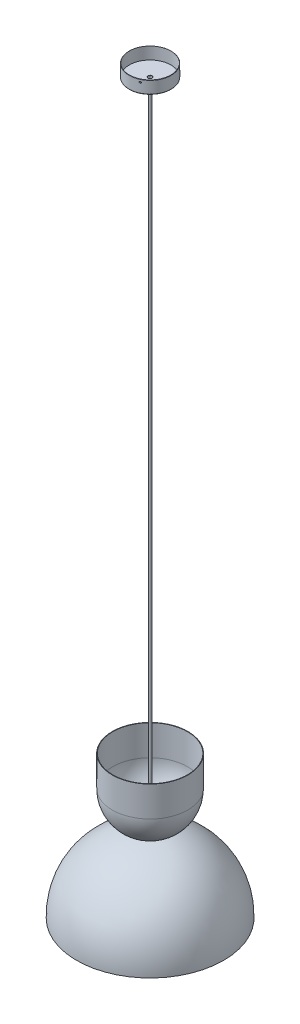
ISO-10303-21;
HEADER;
FILE_DESCRIPTION(('STEP AP214'),'2;1');
FILE_NAME('part.step','',(''),(''),'','','');
FILE_SCHEMA(('AUTOMOTIVE_DESIGN { 1 0 10303 214 1 1 1 1 }'));
ENDSEC;
DATA;
#1=APPLICATION_CONTEXT('core data for automotive mechanical design processes');
#2=APPLICATION_PROTOCOL_DEFINITION('international standard','automotive_design',2000,#1);
#3=PRODUCT_CONTEXT('',#1,'mechanical');
#4=PRODUCT('Part','Part','',(#3));
#5=PRODUCT_RELATED_PRODUCT_CATEGORY('part','',(#4));
#6=PRODUCT_DEFINITION_FORMATION('','',#4);
#7=PRODUCT_DEFINITION_CONTEXT('part definition',#1,'design');
#8=PRODUCT_DEFINITION('design','',#6,#7);
#9=PRODUCT_DEFINITION_SHAPE('','',#8);
#10=(LENGTH_UNIT() NAMED_UNIT(*) SI_UNIT(.MILLI.,.METRE.));
#11=(NAMED_UNIT(*) PLANE_ANGLE_UNIT() SI_UNIT($,.RADIAN.));
#12=(NAMED_UNIT(*) SI_UNIT($,.STERADIAN.) SOLID_ANGLE_UNIT());
#13=UNCERTAINTY_MEASURE_WITH_UNIT(LENGTH_MEASURE(1.E-05),#10,'distance_accuracy_value','');
#14=(GEOMETRIC_REPRESENTATION_CONTEXT(3) GLOBAL_UNCERTAINTY_ASSIGNED_CONTEXT((#13)) GLOBAL_UNIT_ASSIGNED_CONTEXT((#10,
#11,#12)) REPRESENTATION_CONTEXT('',''));
#15=CARTESIAN_POINT('',(0.,0.,0.));
#16=DIRECTION('',(0.,0.,1.));
#17=DIRECTION('',(1.,0.,0.));
#18=AXIS2_PLACEMENT_3D('',#15,#16,#17);
#19=CARTESIAN_POINT('',(-2717.44039150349,2578.48355736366,395.198130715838));
#20=DIRECTION('',(-0.433434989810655,0.,-0.901184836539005));
#21=DIRECTION('',(0.901184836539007,0.,-0.433434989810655));
#22=AXIS2_PLACEMENT_3D('',#19,#20,#21);
#23=CONICAL_SURFACE('',#22,2.16156164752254,0.767944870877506);
#24=CARTESIAN_POINT('',(-2717.35601975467,2578.48355736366,395.373553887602));
#25=DIRECTION('',(0.433434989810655,0.,0.901184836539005));
#26=DIRECTION('',(-0.901184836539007,0.,0.433434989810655));
#27=AXIS2_PLACEMENT_3D('',#24,#25,#26);
#28=CIRCLE('',#27,1.97358224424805);
#29=CARTESIAN_POINT('',(-2715.57745736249,2578.48355736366,394.518134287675));
#30=VERTEX_POINT('',#29);
#31=EDGE_CURVE('P0_E10',#30,#30,#28,.T.);
#32=CARTESIAN_POINT('',(-2717.44039150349,2578.48355736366,395.198130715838));
#33=DIRECTION('',(-0.433434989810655,0.,-0.901184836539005));
#34=DIRECTION('',(0.901184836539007,0.,-0.433434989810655));
#35=AXIS2_PLACEMENT_3D('',#32,#33,#34);
#36=CIRCLE('',#35,2.16156164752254);
#37=CARTESIAN_POINT('',(-2715.4924249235,2578.48355736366,394.261234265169));
#38=VERTEX_POINT('',#37);
#39=EDGE_CURVE('P0_E26',#38,#38,#36,.T.);
#40=CARTESIAN_POINT('',(-2715.57745736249,2578.48355736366,394.518134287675));
#41=CARTESIAN_POINT('',(-2715.57657160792,2578.48355736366,394.515458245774));
#42=CARTESIAN_POINT('',(-2715.57568585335,2578.48355736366,394.512782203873));
#43=CARTESIAN_POINT('',(-2715.5739143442,2578.48355736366,394.507430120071));
#44=CARTESIAN_POINT('',(-2715.57302858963,2578.48355736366,394.50475407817));
#45=CARTESIAN_POINT('',(-2715.57125708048,2578.48355736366,394.499401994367));
#46=CARTESIAN_POINT('',(-2715.57037132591,2578.48355736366,394.496725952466));
#47=CARTESIAN_POINT('',(-2715.56859981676,2578.48355736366,394.491373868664));
#48=CARTESIAN_POINT('',(-2715.56771406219,2578.48355736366,394.488697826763));
#49=CARTESIAN_POINT('',(-2715.56594255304,2578.48355736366,394.483345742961));
#50=CARTESIAN_POINT('',(-2715.56505679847,2578.48355736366,394.48066970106));
#51=CARTESIAN_POINT('',(-2715.56328528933,2578.48355736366,394.475317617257));
#52=CARTESIAN_POINT('',(-2715.56239953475,2578.48355736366,394.472641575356));
#53=CARTESIAN_POINT('',(-2715.56062802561,2578.48355736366,394.467289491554));
#54=CARTESIAN_POINT('',(-2715.55974227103,2578.48355736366,394.464613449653));
#55=CARTESIAN_POINT('',(-2715.55797076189,2578.48355736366,394.459261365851));
#56=CARTESIAN_POINT('',(-2715.55708500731,2578.48355736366,394.45658532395));
#57=CARTESIAN_POINT('',(-2715.55531349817,2578.48355736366,394.451233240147));
#58=CARTESIAN_POINT('',(-2715.5544277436,2578.48355736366,394.448557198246));
#59=CARTESIAN_POINT('',(-2715.55265623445,2578.48355736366,394.443205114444));
#60=CARTESIAN_POINT('',(-2715.55177047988,2578.48355736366,394.440529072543));
#61=CARTESIAN_POINT('',(-2715.54999897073,2578.48355736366,394.435176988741));
#62=CARTESIAN_POINT('',(-2715.54911321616,2578.48355736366,394.43250094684));
#63=CARTESIAN_POINT('',(-2715.54734170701,2578.48355736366,394.427148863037));
#64=CARTESIAN_POINT('',(-2715.54645595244,2578.48355736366,394.424472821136));
#65=CARTESIAN_POINT('',(-2715.54468444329,2578.48355736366,394.419120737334));
#66=CARTESIAN_POINT('',(-2715.54379868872,2578.48355736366,394.416444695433));
#67=CARTESIAN_POINT('',(-2715.54202717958,2578.48355736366,394.411092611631));
#68=CARTESIAN_POINT('',(-2715.541141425,2578.48355736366,394.40841656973));
#69=CARTESIAN_POINT('',(-2715.53936991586,2578.48355736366,394.403064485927));
#70=CARTESIAN_POINT('',(-2715.53848416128,2578.48355736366,394.400388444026));
#71=CARTESIAN_POINT('',(-2715.53671265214,2578.48355736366,394.395036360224));
#72=CARTESIAN_POINT('',(-2715.53582689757,2578.48355736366,394.392360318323));
#73=CARTESIAN_POINT('',(-2715.53405538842,2578.48355736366,394.387008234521));
#74=CARTESIAN_POINT('',(-2715.53316963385,2578.48355736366,394.38433219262));
#75=CARTESIAN_POINT('',(-2715.5313981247,2578.48355736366,394.378980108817));
#76=CARTESIAN_POINT('',(-2715.53051237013,2578.48355736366,394.376304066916));
#77=CARTESIAN_POINT('',(-2715.52874086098,2578.48355736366,394.370951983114));
#78=CARTESIAN_POINT('',(-2715.52785510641,2578.48355736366,394.368275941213));
#79=CARTESIAN_POINT('',(-2715.52608359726,2578.48355736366,394.362923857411));
#80=CARTESIAN_POINT('',(-2715.52519784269,2578.48355736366,394.36024781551));
#81=CARTESIAN_POINT('',(-2715.52342633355,2578.48355736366,394.354895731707));
#82=CARTESIAN_POINT('',(-2715.52254057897,2578.48355736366,394.352219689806));
#83=CARTESIAN_POINT('',(-2715.52076906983,2578.48355736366,394.346867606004));
#84=CARTESIAN_POINT('',(-2715.51988331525,2578.48355736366,394.344191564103));
#85=CARTESIAN_POINT('',(-2715.51811180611,2578.48355736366,394.338839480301));
#86=CARTESIAN_POINT('',(-2715.51722605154,2578.48355736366,394.3361634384));
#87=CARTESIAN_POINT('',(-2715.51545454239,2578.48355736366,394.330811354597));
#88=CARTESIAN_POINT('',(-2715.51456878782,2578.48355736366,394.328135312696));
#89=CARTESIAN_POINT('',(-2715.51279727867,2578.48355736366,394.322783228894));
#90=CARTESIAN_POINT('',(-2715.5119115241,2578.48355736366,394.320107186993));
#91=CARTESIAN_POINT('',(-2715.51014001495,2578.48355736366,394.314755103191));
#92=CARTESIAN_POINT('',(-2715.50925426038,2578.48355736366,394.31207906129));
#93=CARTESIAN_POINT('',(-2715.50748275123,2578.48355736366,394.306726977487));
#94=CARTESIAN_POINT('',(-2715.50659699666,2578.48355736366,394.304050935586));
#95=CARTESIAN_POINT('',(-2715.50482548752,2578.48355736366,394.298698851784));
#96=CARTESIAN_POINT('',(-2715.50393973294,2578.48355736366,394.296022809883));
#97=CARTESIAN_POINT('',(-2715.5021682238,2578.48355736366,394.290670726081));
#98=CARTESIAN_POINT('',(-2715.50128246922,2578.48355736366,394.28799468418));
#99=CARTESIAN_POINT('',(-2715.49951096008,2578.48355736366,394.282642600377));
#100=CARTESIAN_POINT('',(-2715.49862520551,2578.48355736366,394.279966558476));
#101=CARTESIAN_POINT('',(-2715.49685369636,2578.48355736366,394.274614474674));
#102=CARTESIAN_POINT('',(-2715.49596794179,2578.48355736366,394.271938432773));
#103=CARTESIAN_POINT('',(-2715.49419643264,2578.48355736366,394.266586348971));
#104=CARTESIAN_POINT('',(-2715.49331067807,2578.48355736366,394.26391030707));
#105=CARTESIAN_POINT('',(-2715.4924249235,2578.48355736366,394.261234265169));
#106=B_SPLINE_CURVE_WITH_KNOTS('',3,(#40,#41,#42,#43,#44,#45,#46,#47,#48,#49,#50,#51,#52,#53,
#54,#55,#56,#57,#58,#59,#60,#61,#62,#63,#64,#65,#66,#67,#68,#69,#70,#71,#72,#73,#74,#75,#76,#77,
#78,#79,#80,#81,#82,#83,#84,#85,#86,#87,#88,#89,#90,#91,#92,#93,#94,#95,#96,#97,#98,#99,#100,
#101,#102,#103,#104,#105),.UNSPECIFIED.,.F.,.F.,(4,2,2,2,2,2,2,2,2,2,2,2,2,2,2,2,2,2,2,2,2,2,2,
2,2,2,2,2,2,2,2,2,4),(0.,0.00845646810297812,0.0169129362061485,0.0253694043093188,
0.033825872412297,0.0422823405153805,0.0507388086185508,0.0591952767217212,0.0676517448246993,
0.0761082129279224,0.0845646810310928,0.093021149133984,0.101477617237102,0.109934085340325,
0.118390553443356,0.126847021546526,0.135303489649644,0.143759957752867,0.152216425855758,
0.160672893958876,0.169129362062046,0.177585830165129,0.1860422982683,0.194498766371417,
0.202955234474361,0.211411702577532,0.219868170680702,0.22832463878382,0.236781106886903,
0.245237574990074,0.253694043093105,0.262150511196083,0.270606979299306),.UNSPECIFIED.);
#107=EDGE_CURVE('P0_BSEAM15',#30,#38,#106,.T.);
#108=ORIENTED_EDGE('',*,*,#31,.F.);
#109=ORIENTED_EDGE('',*,*,#39,.F.);
#110=ORIENTED_EDGE('',*,*,#107,.T.);
#111=ORIENTED_EDGE('',*,*,#107,.F.);
#112=EDGE_LOOP('',(#108,#110,#109,#111));
#113=FACE_BOUND('',#112,.T.);
#114=ADVANCED_FACE('P0_F15',(#113),#23,.T.);
#115=CARTESIAN_POINT('',(-2717.22367400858,2578.48355736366,395.648723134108));
#116=DIRECTION('',(0.433434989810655,0.,0.901184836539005));
#117=DIRECTION('',(0.901184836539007,0.,-0.433434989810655));
#118=AXIS2_PLACEMENT_3D('',#115,#116,#117);
#119=PLANE('',#118);
#120=CARTESIAN_POINT('',(-2717.22367400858,2578.48355736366,395.648723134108));
#121=DIRECTION('',(-0.433434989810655,0.,-0.901184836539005));
#122=DIRECTION('',(0.901184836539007,0.,-0.433434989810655));
#123=AXIS2_PLACEMENT_3D('',#120,#121,#122);
#124=CIRCLE('',#123,1.2542424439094);
#125=CARTESIAN_POINT('',(-2716.09336973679,2578.48355736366,395.105090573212));
#126=VERTEX_POINT('',#125);
#127=EDGE_CURVE('P0_E22',#126,#126,#124,.T.);
#128=ORIENTED_EDGE('',*,*,#127,.F.);
#129=EDGE_LOOP('',(#128));
#130=FACE_BOUND('',#129,.T.);
#131=ADVANCED_FACE('P0_F36',(#130),#119,.T.);
#132=CARTESIAN_POINT('',(-2717.44039150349,2578.48355736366,395.198130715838));
#133=DIRECTION('',(0.433434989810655,0.,0.901184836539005));
#134=DIRECTION('',(0.901184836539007,0.,-0.433434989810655));
#135=AXIS2_PLACEMENT_3D('',#132,#133,#134);
#136=PLANE('',#135);
#137=ORIENTED_EDGE('',*,*,#39,.T.);
#138=EDGE_LOOP('',(#137));
#139=FACE_BOUND('',#138,.T.);
#140=ADVANCED_FACE('P0_F33',(#139),#136,.F.);
#141=CARTESIAN_POINT('',(-2717.65710899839,2578.48355736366,394.74753829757));
#142=DIRECTION('',(0.433434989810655,0.,0.901184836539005));
#143=DIRECTION('',(0.901184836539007,0.,-0.433434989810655));
#144=AXIS2_PLACEMENT_3D('',#141,#142,#143);
#145=TOROIDAL_SURFACE('',#144,1.2542424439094,1.);
#146=ORIENTED_EDGE('',*,*,#31,.T.);
#147=EDGE_LOOP('',(#146));
#148=FACE_BOUND('',#147,.T.);
#149=ORIENTED_EDGE('',*,*,#127,.T.);
#150=EDGE_LOOP('',(#149));
#151=FACE_BOUND('',#150,.T.);
#152=ADVANCED_FACE('P0_F17',(#148,#151),#145,.T.);
#153=CLOSED_SHELL('',(#114,#131,#140,#152));
#154=MANIFOLD_SOLID_BREP('P0_B1',#153);
#155=CARTESIAN_POINT('',(-2760.78389048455,2578.48355736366,305.079647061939));
#156=DIRECTION('',(0.433434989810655,0.,0.901184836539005));
#157=DIRECTION('',(0.901184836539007,0.,-0.433434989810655));
#158=AXIS2_PLACEMENT_3D('',#155,#156,#157);
#159=CONICAL_SURFACE('',#158,2.16156164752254,0.767944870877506);
#160=CARTESIAN_POINT('',(-2760.86826223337,2578.48355736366,304.904223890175));
#161=DIRECTION('',(0.433434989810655,0.,0.901184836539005));
#162=DIRECTION('',(-0.901184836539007,0.,0.433434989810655));
#163=AXIS2_PLACEMENT_3D('',#160,#161,#162);
#164=CIRCLE('',#163,1.97358224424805);
#165=CARTESIAN_POINT('',(-2759.08969984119,2578.48355736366,304.04880429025));
#166=VERTEX_POINT('',#165);
#167=EDGE_CURVE('P1_E10',#166,#166,#164,.T.);
#168=CARTESIAN_POINT('',(-2760.78389048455,2578.48355736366,305.079647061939));
#169=DIRECTION('',(-0.433434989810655,0.,-0.901184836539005));
#170=DIRECTION('',(0.901184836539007,0.,-0.433434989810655));
#171=AXIS2_PLACEMENT_3D('',#168,#169,#170);
#172=CIRCLE('',#171,2.16156164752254);
#173=CARTESIAN_POINT('',(-2758.83592390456,2578.48355736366,304.14275061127));
#174=VERTEX_POINT('',#173);
#175=EDGE_CURVE('P1_E26',#174,#174,#172,.T.);
#176=CARTESIAN_POINT('',(-2759.08969984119,2578.48355736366,304.04880429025));
#177=CARTESIAN_POINT('',(-2759.08705634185,2578.48355736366,304.04978289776));
#178=CARTESIAN_POINT('',(-2759.08441284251,2578.48355736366,304.050761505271));
#179=CARTESIAN_POINT('',(-2759.07912584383,2578.48355736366,304.052718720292));
#180=CARTESIAN_POINT('',(-2759.07648234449,2578.48355736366,304.053697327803));
#181=CARTESIAN_POINT('',(-2759.07119534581,2578.48355736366,304.055654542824));
#182=CARTESIAN_POINT('',(-2759.06855184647,2578.48355736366,304.056633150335));
#183=CARTESIAN_POINT('',(-2759.06326484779,2578.48355736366,304.058590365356));
#184=CARTESIAN_POINT('',(-2759.06062134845,2578.48355736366,304.059568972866));
#185=CARTESIAN_POINT('',(-2759.05533434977,2578.48355736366,304.061526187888));
#186=CARTESIAN_POINT('',(-2759.05269085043,2578.48355736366,304.062504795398));
#187=CARTESIAN_POINT('',(-2759.04740385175,2578.48355736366,304.06446201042));
#188=CARTESIAN_POINT('',(-2759.04476035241,2578.48355736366,304.06544061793));
#189=CARTESIAN_POINT('',(-2759.03947335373,2578.48355736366,304.067397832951));
#190=CARTESIAN_POINT('',(-2759.03682985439,2578.48355736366,304.068376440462));
#191=CARTESIAN_POINT('',(-2759.03154285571,2578.48355736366,304.070333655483));
#192=CARTESIAN_POINT('',(-2759.02889935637,2578.48355736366,304.071312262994));
#193=CARTESIAN_POINT('',(-2759.02361235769,2578.48355736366,304.073269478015));
#194=CARTESIAN_POINT('',(-2759.02096885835,2578.48355736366,304.074248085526));
#195=CARTESIAN_POINT('',(-2759.01568185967,2578.48355736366,304.076205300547));
#196=CARTESIAN_POINT('',(-2759.01303836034,2578.48355736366,304.077183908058));
#197=CARTESIAN_POINT('',(-2759.00775136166,2578.48355736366,304.079141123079));
#198=CARTESIAN_POINT('',(-2759.00510786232,2578.48355736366,304.08011973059));
#199=CARTESIAN_POINT('',(-2758.99982086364,2578.48355736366,304.082076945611));
#200=CARTESIAN_POINT('',(-2758.9971773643,2578.48355736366,304.083055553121));
#201=CARTESIAN_POINT('',(-2758.99189036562,2578.48355736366,304.085012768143));
#202=CARTESIAN_POINT('',(-2758.98924686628,2578.48355736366,304.085991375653));
#203=CARTESIAN_POINT('',(-2758.9839598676,2578.48355736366,304.087948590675));
#204=CARTESIAN_POINT('',(-2758.98131636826,2578.48355736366,304.088927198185));
#205=CARTESIAN_POINT('',(-2758.97602936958,2578.48355736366,304.090884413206));
#206=CARTESIAN_POINT('',(-2758.97338587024,2578.48355736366,304.091863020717));
#207=CARTESIAN_POINT('',(-2758.96809887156,2578.48355736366,304.093820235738));
#208=CARTESIAN_POINT('',(-2758.96545537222,2578.48355736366,304.094798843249));
#209=CARTESIAN_POINT('',(-2758.96016837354,2578.48355736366,304.09675605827));
#210=CARTESIAN_POINT('',(-2758.9575248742,2578.48355736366,304.097734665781));
#211=CARTESIAN_POINT('',(-2758.95223787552,2578.48355736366,304.099691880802));
#212=CARTESIAN_POINT('',(-2758.94959437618,2578.48355736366,304.100670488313));
#213=CARTESIAN_POINT('',(-2758.9443073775,2578.48355736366,304.102627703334));
#214=CARTESIAN_POINT('',(-2758.94166387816,2578.48355736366,304.103606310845));
#215=CARTESIAN_POINT('',(-2758.93637687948,2578.48355736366,304.105563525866));
#216=CARTESIAN_POINT('',(-2758.93373338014,2578.48355736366,304.106542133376));
#217=CARTESIAN_POINT('',(-2758.92844638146,2578.48355736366,304.108499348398));
#218=CARTESIAN_POINT('',(-2758.92580288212,2578.48355736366,304.109477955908));
#219=CARTESIAN_POINT('',(-2758.92051588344,2578.48355736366,304.11143517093));
#220=CARTESIAN_POINT('',(-2758.9178723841,2578.48355736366,304.11241377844));
#221=CARTESIAN_POINT('',(-2758.91258538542,2578.48355736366,304.114370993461));
#222=CARTESIAN_POINT('',(-2758.90994188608,2578.48355736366,304.115349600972));
#223=CARTESIAN_POINT('',(-2758.9046548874,2578.48355736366,304.117306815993));
#224=CARTESIAN_POINT('',(-2758.90201138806,2578.48355736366,304.118285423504));
#225=CARTESIAN_POINT('',(-2758.89672438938,2578.48355736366,304.120242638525));
#226=CARTESIAN_POINT('',(-2758.89408089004,2578.48355736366,304.121221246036));
#227=CARTESIAN_POINT('',(-2758.88879389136,2578.48355736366,304.123178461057));
#228=CARTESIAN_POINT('',(-2758.88615039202,2578.48355736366,304.124157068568));
#229=CARTESIAN_POINT('',(-2758.88086339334,2578.48355736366,304.126114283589));
#230=CARTESIAN_POINT('',(-2758.878219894,2578.48355736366,304.127092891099));
#231=CARTESIAN_POINT('',(-2758.87293289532,2578.48355736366,304.129050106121));
#232=CARTESIAN_POINT('',(-2758.87028939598,2578.48355736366,304.130028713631));
#233=CARTESIAN_POINT('',(-2758.8650023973,2578.48355736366,304.131985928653));
#234=CARTESIAN_POINT('',(-2758.86235889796,2578.48355736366,304.132964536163));
#235=CARTESIAN_POINT('',(-2758.85707189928,2578.48355736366,304.134921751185));
#236=CARTESIAN_POINT('',(-2758.85442839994,2578.48355736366,304.135900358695));
#237=CARTESIAN_POINT('',(-2758.84914140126,2578.48355736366,304.137857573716));
#238=CARTESIAN_POINT('',(-2758.84649790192,2578.48355736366,304.138836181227));
#239=CARTESIAN_POINT('',(-2758.84121090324,2578.48355736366,304.140793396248));
#240=CARTESIAN_POINT('',(-2758.8385674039,2578.48355736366,304.141772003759));
#241=CARTESIAN_POINT('',(-2758.83592390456,2578.48355736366,304.14275061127));
#242=B_SPLINE_CURVE_WITH_KNOTS('',3,(#176,#177,#178,#179,#180,#181,#182,#183,#184,#185,#186,
#187,#188,#189,#190,#191,#192,#193,#194,#195,#196,#197,#198,#199,#200,#201,#202,#203,#204,#205,
#206,#207,#208,#209,#210,#211,#212,#213,#214,#215,#216,#217,#218,#219,#220,#221,#222,#223,#224,
#225,#226,#227,#228,#229,#230,#231,#232,#233,#234,#235,#236,#237,#238,#239,#240,#241),
.UNSPECIFIED.,.F.,.F.,(4,2,2,2,2,2,2,2,2,2,2,2,2,2,2,2,2,2,2,2,2,2,2,2,2,2,2,2,2,2,2,2,4),(0.,
0.00845646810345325,0.0169129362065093,0.0253694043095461,0.0338258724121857,0.0422823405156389,
0.0507388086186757,0.0591952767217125,0.0676517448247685,0.0761082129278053,0.0845646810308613,
0.0930211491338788,0.101477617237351,0.109934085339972,0.118390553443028,0.126847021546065,
0.135303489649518,0.143759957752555,0.152216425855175,0.160672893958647,0.169129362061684,
0.17758583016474,0.186042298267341,0.194498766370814,0.20295523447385,0.211411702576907,
0.219868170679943,0.22832463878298,0.236781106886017,0.245237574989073,0.253694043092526,
0.262150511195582,0.270606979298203),.UNSPECIFIED.);
#243=EDGE_CURVE('P1_BSEAM15',#166,#174,#242,.T.);
#244=ORIENTED_EDGE('',*,*,#167,.T.);
#245=ORIENTED_EDGE('',*,*,#175,.T.);
#246=ORIENTED_EDGE('',*,*,#243,.T.);
#247=ORIENTED_EDGE('',*,*,#243,.F.);
#248=EDGE_LOOP('',(#244,#246,#245,#247));
#249=FACE_BOUND('',#248,.T.);
#250=ADVANCED_FACE('P1_F15',(#249),#159,.T.);
#251=CARTESIAN_POINT('',(-2761.00060797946,2578.48355736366,304.629054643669));
#252=DIRECTION('',(-0.433434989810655,0.,-0.901184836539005));
#253=DIRECTION('',(0.901184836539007,0.,-0.433434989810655));
#254=AXIS2_PLACEMENT_3D('',#251,#252,#253);
#255=PLANE('',#254);
#256=CARTESIAN_POINT('',(-2761.00060797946,2578.48355736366,304.629054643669));
#257=DIRECTION('',(-0.433434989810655,0.,-0.901184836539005));
#258=DIRECTION('',(0.901184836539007,0.,-0.433434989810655));
#259=AXIS2_PLACEMENT_3D('',#256,#257,#258);
#260=CIRCLE('',#259,1.2542424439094);
#261=CARTESIAN_POINT('',(-2759.87030370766,2578.48355736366,304.085422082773));
#262=VERTEX_POINT('',#261);
#263=EDGE_CURVE('P1_E22',#262,#262,#260,.T.);
#264=ORIENTED_EDGE('',*,*,#263,.T.);
#265=EDGE_LOOP('',(#264));
#266=FACE_BOUND('',#265,.T.);
#267=ADVANCED_FACE('P1_F36',(#266),#255,.T.);
#268=CARTESIAN_POINT('',(-2760.78389048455,2578.48355736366,305.079647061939));
#269=DIRECTION('',(-0.433434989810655,0.,-0.901184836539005));
#270=DIRECTION('',(0.901184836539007,0.,-0.433434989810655));
#271=AXIS2_PLACEMENT_3D('',#268,#269,#270);
#272=PLANE('',#271);
#273=ORIENTED_EDGE('',*,*,#175,.F.);
#274=EDGE_LOOP('',(#273));
#275=FACE_BOUND('',#274,.T.);
#276=ADVANCED_FACE('P1_F34',(#275),#272,.F.);
#277=CARTESIAN_POINT('',(-2760.56717298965,2578.48355736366,305.530239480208));
#278=DIRECTION('',(-0.433434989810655,0.,-0.901184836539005));
#279=DIRECTION('',(0.901184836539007,0.,-0.433434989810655));
#280=AXIS2_PLACEMENT_3D('',#277,#278,#279);
#281=TOROIDAL_SURFACE('',#280,1.2542424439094,1.);
#282=ORIENTED_EDGE('',*,*,#167,.F.);
#283=EDGE_LOOP('',(#282));
#284=FACE_BOUND('',#283,.T.);
#285=ORIENTED_EDGE('',*,*,#263,.F.);
#286=EDGE_LOOP('',(#285));
#287=FACE_BOUND('',#286,.T.);
#288=ADVANCED_FACE('P1_F17',(#284,#287),#281,.T.);
#289=CLOSED_SHELL('',(#250,#267,#276,#288));
#290=MANIFOLD_SOLID_BREP('P1_B1',#289);
#291=CARTESIAN_POINT('',(-2739.11214099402,2555.26677943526,350.138888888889));
#292=DIRECTION('',(0.,0.999999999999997,0.));
#293=DIRECTION('',(0.433434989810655,0.,0.901184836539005));
#294=AXIS2_PLACEMENT_3D('',#291,#292,#293);
#295=CYLINDRICAL_SURFACE('',#294,50.);
#296=CARTESIAN_POINT('',(-2739.11214099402,2584.26677943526,350.138888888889));
#297=DIRECTION('',(0.,-0.999999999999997,0.));
#298=DIRECTION('',(-0.433434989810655,0.,-0.901184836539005));
#299=AXIS2_PLACEMENT_3D('',#296,#297,#298);
#300=CIRCLE('',#299,50.);
#301=CARTESIAN_POINT('',(-2717.44039150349,2584.26677943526,395.198130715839));
#302=VERTEX_POINT('',#301);
#303=EDGE_CURVE('P2_E10',#302,#302,#300,.T.);
#304=CARTESIAN_POINT('',(-2739.11214099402,2556.26677943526,350.138888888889));
#305=DIRECTION('',(0.,-0.999999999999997,0.));
#306=DIRECTION('',(-0.433434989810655,0.,-0.901184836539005));
#307=AXIS2_PLACEMENT_3D('',#304,#305,#306);
#308=CIRCLE('',#307,50.);
#309=CARTESIAN_POINT('',(-2717.44039150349,2556.26677943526,395.198130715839));
#310=VERTEX_POINT('',#309);
#311=EDGE_CURVE('P2_E23',#310,#310,#308,.F.);
#312=CARTESIAN_POINT('',(-2717.44039150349,2584.26677943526,395.198130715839));
#313=CARTESIAN_POINT('',(-2717.44039150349,2583.97511276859,395.198130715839));
#314=CARTESIAN_POINT('',(-2717.44039150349,2583.68344610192,395.198130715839));
#315=CARTESIAN_POINT('',(-2717.44039150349,2583.10011276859,395.198130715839));
#316=CARTESIAN_POINT('',(-2717.44039150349,2582.80844610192,395.198130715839));
#317=CARTESIAN_POINT('',(-2717.44039150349,2582.22511276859,395.198130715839));
#318=CARTESIAN_POINT('',(-2717.44039150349,2581.93344610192,395.198130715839));
#319=CARTESIAN_POINT('',(-2717.44039150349,2581.35011276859,395.198130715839));
#320=CARTESIAN_POINT('',(-2717.44039150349,2581.05844610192,395.198130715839));
#321=CARTESIAN_POINT('',(-2717.44039150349,2580.47511276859,395.198130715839));
#322=CARTESIAN_POINT('',(-2717.44039150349,2580.18344610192,395.198130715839));
#323=CARTESIAN_POINT('',(-2717.44039150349,2579.60011276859,395.198130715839));
#324=CARTESIAN_POINT('',(-2717.44039150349,2579.30844610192,395.198130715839));
#325=CARTESIAN_POINT('',(-2717.44039150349,2578.72511276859,395.198130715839));
#326=CARTESIAN_POINT('',(-2717.44039150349,2578.43344610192,395.198130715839));
#327=CARTESIAN_POINT('',(-2717.44039150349,2577.85011276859,395.198130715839));
#328=CARTESIAN_POINT('',(-2717.44039150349,2577.55844610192,395.198130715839));
#329=CARTESIAN_POINT('',(-2717.44039150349,2576.97511276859,395.198130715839));
#330=CARTESIAN_POINT('',(-2717.44039150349,2576.68344610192,395.198130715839));
#331=CARTESIAN_POINT('',(-2717.44039150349,2576.10011276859,395.198130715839));
#332=CARTESIAN_POINT('',(-2717.44039150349,2575.80844610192,395.198130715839));
#333=CARTESIAN_POINT('',(-2717.44039150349,2575.22511276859,395.198130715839));
#334=CARTESIAN_POINT('',(-2717.44039150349,2574.93344610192,395.198130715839));
#335=CARTESIAN_POINT('',(-2717.44039150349,2574.35011276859,395.198130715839));
#336=CARTESIAN_POINT('',(-2717.44039150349,2574.05844610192,395.198130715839));
#337=CARTESIAN_POINT('',(-2717.44039150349,2573.47511276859,395.198130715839));
#338=CARTESIAN_POINT('',(-2717.44039150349,2573.18344610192,395.198130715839));
#339=CARTESIAN_POINT('',(-2717.44039150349,2572.60011276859,395.198130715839));
#340=CARTESIAN_POINT('',(-2717.44039150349,2572.30844610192,395.198130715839));
#341=CARTESIAN_POINT('',(-2717.44039150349,2571.72511276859,395.198130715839));
#342=CARTESIAN_POINT('',(-2717.44039150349,2571.43344610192,395.198130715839));
#343=CARTESIAN_POINT('',(-2717.44039150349,2570.85011276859,395.198130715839));
#344=CARTESIAN_POINT('',(-2717.44039150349,2570.55844610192,395.198130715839));
#345=CARTESIAN_POINT('',(-2717.44039150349,2569.97511276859,395.198130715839));
#346=CARTESIAN_POINT('',(-2717.44039150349,2569.68344610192,395.198130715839));
#347=CARTESIAN_POINT('',(-2717.44039150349,2569.10011276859,395.198130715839));
#348=CARTESIAN_POINT('',(-2717.44039150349,2568.80844610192,395.198130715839));
#349=CARTESIAN_POINT('',(-2717.44039150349,2568.22511276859,395.198130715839));
#350=CARTESIAN_POINT('',(-2717.44039150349,2567.93344610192,395.198130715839));
#351=CARTESIAN_POINT('',(-2717.44039150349,2567.35011276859,395.198130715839));
#352=CARTESIAN_POINT('',(-2717.44039150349,2567.05844610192,395.198130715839));
#353=CARTESIAN_POINT('',(-2717.44039150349,2566.47511276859,395.198130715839));
#354=CARTESIAN_POINT('',(-2717.44039150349,2566.18344610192,395.198130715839));
#355=CARTESIAN_POINT('',(-2717.44039150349,2565.60011276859,395.198130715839));
#356=CARTESIAN_POINT('',(-2717.44039150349,2565.30844610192,395.198130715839));
#357=CARTESIAN_POINT('',(-2717.44039150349,2564.72511276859,395.198130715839));
#358=CARTESIAN_POINT('',(-2717.44039150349,2564.43344610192,395.198130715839));
#359=CARTESIAN_POINT('',(-2717.44039150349,2563.85011276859,395.198130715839));
#360=CARTESIAN_POINT('',(-2717.44039150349,2563.55844610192,395.198130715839));
#361=CARTESIAN_POINT('',(-2717.44039150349,2562.97511276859,395.198130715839));
#362=CARTESIAN_POINT('',(-2717.44039150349,2562.68344610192,395.198130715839));
#363=CARTESIAN_POINT('',(-2717.44039150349,2562.10011276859,395.198130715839));
#364=CARTESIAN_POINT('',(-2717.44039150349,2561.80844610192,395.198130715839));
#365=CARTESIAN_POINT('',(-2717.44039150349,2561.22511276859,395.198130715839));
#366=CARTESIAN_POINT('',(-2717.44039150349,2560.93344610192,395.198130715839));
#367=CARTESIAN_POINT('',(-2717.44039150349,2560.35011276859,395.198130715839));
#368=CARTESIAN_POINT('',(-2717.44039150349,2560.05844610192,395.198130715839));
#369=CARTESIAN_POINT('',(-2717.44039150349,2559.47511276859,395.198130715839));
#370=CARTESIAN_POINT('',(-2717.44039150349,2559.18344610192,395.198130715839));
#371=CARTESIAN_POINT('',(-2717.44039150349,2558.60011276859,395.198130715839));
#372=CARTESIAN_POINT('',(-2717.44039150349,2558.30844610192,395.198130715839));
#373=CARTESIAN_POINT('',(-2717.44039150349,2557.72511276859,395.198130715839));
#374=CARTESIAN_POINT('',(-2717.44039150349,2557.43344610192,395.198130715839));
#375=CARTESIAN_POINT('',(-2717.44039150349,2556.85011276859,395.198130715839));
#376=CARTESIAN_POINT('',(-2717.44039150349,2556.55844610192,395.198130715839));
#377=CARTESIAN_POINT('',(-2717.44039150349,2556.26677943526,395.198130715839));
#378=B_SPLINE_CURVE_WITH_KNOTS('',3,(#312,#313,#314,#315,#316,#317,#318,#319,#320,#321,#322,
#323,#324,#325,#326,#327,#328,#329,#330,#331,#332,#333,#334,#335,#336,#337,#338,#339,#340,#341,
#342,#343,#344,#345,#346,#347,#348,#349,#350,#351,#352,#353,#354,#355,#356,#357,#358,#359,#360,
#361,#362,#363,#364,#365,#366,#367,#368,#369,#370,#371,#372,#373,#374,#375,#376,#377),
.UNSPECIFIED.,.F.,.F.,(4,2,2,2,2,2,2,2,2,2,2,2,2,2,2,2,2,2,2,2,2,2,2,2,2,2,2,2,2,2,2,2,4),(0.,
0.875000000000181,1.75000000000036,2.6250000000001,3.50000000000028,4.37500000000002,
5.2500000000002,6.12500000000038,7.00000000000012,7.8750000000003,8.75000000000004,
9.62500000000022,10.5000000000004,11.3750000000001,12.2500000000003,13.1250000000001,
14.0000000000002,14.8750000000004,15.7500000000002,16.6250000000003,17.5000000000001,
18.3750000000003,19.2500000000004,20.1250000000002,21.0000000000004,21.8750000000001,
22.7500000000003,23.6250000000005,24.5000000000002,25.3750000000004,26.2500000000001,
27.1250000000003,28.),.UNSPECIFIED.);
#379=EDGE_CURVE('P2_BSEAM15',#302,#310,#378,.T.);
#380=ORIENTED_EDGE('',*,*,#303,.T.);
#381=ORIENTED_EDGE('',*,*,#311,.T.);
#382=ORIENTED_EDGE('',*,*,#379,.T.);
#383=ORIENTED_EDGE('',*,*,#379,.F.);
#384=EDGE_LOOP('',(#380,#382,#381,#383));
#385=FACE_BOUND('',#384,.T.);
#386=ADVANCED_FACE('P2_F15',(#385),#295,.T.);
#387=CARTESIAN_POINT('',(-2739.11214099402,2555.26677943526,350.138888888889));
#388=DIRECTION('',(0.,-0.999999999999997,0.));
#389=DIRECTION('',(-0.433434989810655,0.,-0.901184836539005));
#390=AXIS2_PLACEMENT_3D('',#387,#388,#389);
#391=PLANE('',#390);
#392=CARTESIAN_POINT('',(-2739.11214099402,2555.26677943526,350.138888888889));
#393=DIRECTION('',(0.,-0.999999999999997,0.));
#394=DIRECTION('',(-0.433434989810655,0.,-0.901184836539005));
#395=AXIS2_PLACEMENT_3D('',#392,#393,#394);
#396=CIRCLE('',#395,5.);
#397=CARTESIAN_POINT('',(-2741.27931594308,2555.26677943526,345.632964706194));
#398=VERTEX_POINT('',#397);
#399=EDGE_CURVE('P2_E42',#398,#398,#396,.T.);
#400=ORIENTED_EDGE('',*,*,#399,.F.);
#401=EDGE_LOOP('',(#400));
#402=FACE_BOUND('',#401,.T.);
#403=CARTESIAN_POINT('',(-2739.11214099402,2555.26677943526,350.138888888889));
#404=DIRECTION('',(0.,-0.999999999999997,0.));
#405=DIRECTION('',(-0.433434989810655,0.,-0.901184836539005));
#406=AXIS2_PLACEMENT_3D('',#403,#404,#405);
#407=CIRCLE('',#406,49.);
#408=CARTESIAN_POINT('',(-2760.35045549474,2555.26677943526,305.980831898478));
#409=VERTEX_POINT('',#408);
#410=EDGE_CURVE('P2_E28',#409,#409,#407,.T.);
#411=ORIENTED_EDGE('',*,*,#410,.T.);
#412=EDGE_LOOP('',(#411));
#413=FACE_BOUND('',#412,.T.);
#414=ADVANCED_FACE('P2_F49',(#402,#413),#391,.T.);
#415=CARTESIAN_POINT('',(-2739.11214099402,2556.26677943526,350.138888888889));
#416=DIRECTION('',(0.,-0.999999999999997,0.));
#417=DIRECTION('',(-0.433434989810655,0.,-0.901184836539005));
#418=AXIS2_PLACEMENT_3D('',#415,#416,#417);
#419=TOROIDAL_SURFACE('',#418,49.,1.);
#420=ORIENTED_EDGE('',*,*,#311,.F.);
#421=EDGE_LOOP('',(#420));
#422=FACE_BOUND('',#421,.T.);
#423=ORIENTED_EDGE('',*,*,#410,.F.);
#424=EDGE_LOOP('',(#423));
#425=FACE_BOUND('',#424,.T.);
#426=ADVANCED_FACE('P2_F52',(#422,#425),#419,.T.);
#427=CARTESIAN_POINT('',(-2739.11214099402,2584.26677943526,350.138888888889));
#428=DIRECTION('',(0.,-0.999999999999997,0.));
#429=DIRECTION('',(-0.433434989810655,0.,-0.901184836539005));
#430=AXIS2_PLACEMENT_3D('',#427,#428,#429);
#431=TOROIDAL_SURFACE('',#430,49.,1.);
#432=CARTESIAN_POINT('',(-2739.11214099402,2585.13280483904,350.138888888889));
#433=DIRECTION('',(0.,-0.999999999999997,0.));
#434=DIRECTION('',(-0.433434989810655,0.,-0.901184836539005));
#435=AXIS2_PLACEMENT_3D('',#432,#433,#434);
#436=CIRCLE('',#435,49.5);
#437=CARTESIAN_POINT('',(-2717.65710899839,2585.13280483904,394.74753829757));
#438=VERTEX_POINT('',#437);
#439=EDGE_CURVE('P2_E31',#438,#438,#436,.F.);
#440=ORIENTED_EDGE('',*,*,#439,.F.);
#441=EDGE_LOOP('',(#440));
#442=FACE_BOUND('',#441,.T.);
#443=ORIENTED_EDGE('',*,*,#303,.F.);
#444=EDGE_LOOP('',(#443));
#445=FACE_BOUND('',#444,.T.);
#446=ADVANCED_FACE('P2_F17',(#442,#445),#431,.T.);
#447=CARTESIAN_POINT('',(-2739.11214099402,2556.26677943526,350.138888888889));
#448=DIRECTION('',(0.,0.999999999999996,0.));
#449=DIRECTION('',(0.433434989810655,0.,0.901184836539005));
#450=AXIS2_PLACEMENT_3D('',#447,#448,#449);
#451=CYLINDRICAL_SURFACE('',#450,49.5);
#452=CARTESIAN_POINT('',(-2739.11214099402,2556.26677943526,350.138888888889));
#453=DIRECTION('',(0.,0.999999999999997,0.));
#454=DIRECTION('',(0.433434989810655,0.,0.901184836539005));
#455=AXIS2_PLACEMENT_3D('',#452,#453,#454);
#456=CIRCLE('',#455,49.5);
#457=CARTESIAN_POINT('',(-2717.65710899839,2556.26677943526,394.74753829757));
#458=VERTEX_POINT('',#457);
#459=EDGE_CURVE('P2_E33',#458,#458,#456,.T.);
#460=CARTESIAN_POINT('',(-2717.65710899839,2585.13280483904,394.74753829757));
#461=CARTESIAN_POINT('',(-2717.65710899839,2584.83211707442,394.74753829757));
#462=CARTESIAN_POINT('',(-2717.65710899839,2584.5314293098,394.74753829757));
#463=CARTESIAN_POINT('',(-2717.65710899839,2583.93005378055,394.74753829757));
#464=CARTESIAN_POINT('',(-2717.65710899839,2583.62936601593,394.74753829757));
#465=CARTESIAN_POINT('',(-2717.65710899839,2583.02799048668,394.74753829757));
#466=CARTESIAN_POINT('',(-2717.65710899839,2582.72730272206,394.74753829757));
#467=CARTESIAN_POINT('',(-2717.65710899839,2582.12592719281,394.74753829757));
#468=CARTESIAN_POINT('',(-2717.65710899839,2581.82523942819,394.74753829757));
#469=CARTESIAN_POINT('',(-2717.65710899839,2581.22386389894,394.74753829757));
#470=CARTESIAN_POINT('',(-2717.65710899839,2580.92317613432,394.74753829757));
#471=CARTESIAN_POINT('',(-2717.65710899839,2580.32180060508,394.74753829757));
#472=CARTESIAN_POINT('',(-2717.65710899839,2580.02111284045,394.74753829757));
#473=CARTESIAN_POINT('',(-2717.65710899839,2579.41973731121,394.74753829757));
#474=CARTESIAN_POINT('',(-2717.65710899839,2579.11904954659,394.74753829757));
#475=CARTESIAN_POINT('',(-2717.65710899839,2578.51767401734,394.74753829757));
#476=CARTESIAN_POINT('',(-2717.65710899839,2578.21698625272,394.74753829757));
#477=CARTESIAN_POINT('',(-2717.65710899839,2577.61561072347,394.74753829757));
#478=CARTESIAN_POINT('',(-2717.65710899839,2577.31492295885,394.74753829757));
#479=CARTESIAN_POINT('',(-2717.65710899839,2576.7135474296,394.74753829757));
#480=CARTESIAN_POINT('',(-2717.65710899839,2576.41285966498,394.74753829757));
#481=CARTESIAN_POINT('',(-2717.65710899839,2575.81148413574,394.74753829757));
#482=CARTESIAN_POINT('',(-2717.65710899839,2575.51079637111,394.74753829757));
#483=CARTESIAN_POINT('',(-2717.65710899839,2574.90942084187,394.74753829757));
#484=CARTESIAN_POINT('',(-2717.65710899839,2574.60873307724,394.74753829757));
#485=CARTESIAN_POINT('',(-2717.65710899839,2574.007357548,394.74753829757));
#486=CARTESIAN_POINT('',(-2717.65710899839,2573.70666978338,394.74753829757));
#487=CARTESIAN_POINT('',(-2717.65710899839,2573.10529425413,394.74753829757));
#488=CARTESIAN_POINT('',(-2717.65710899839,2572.80460648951,394.74753829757));
#489=CARTESIAN_POINT('',(-2717.65710899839,2572.20323096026,394.74753829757));
#490=CARTESIAN_POINT('',(-2717.65710899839,2571.90254319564,394.74753829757));
#491=CARTESIAN_POINT('',(-2717.65710899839,2571.30116766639,394.74753829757));
#492=CARTESIAN_POINT('',(-2717.65710899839,2571.00047990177,394.74753829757));
#493=CARTESIAN_POINT('',(-2717.65710899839,2570.39910437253,394.74753829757));
#494=CARTESIAN_POINT('',(-2717.65710899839,2570.0984166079,394.74753829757));
#495=CARTESIAN_POINT('',(-2717.65710899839,2569.49704107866,394.74753829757));
#496=CARTESIAN_POINT('',(-2717.65710899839,2569.19635331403,394.74753829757));
#497=CARTESIAN_POINT('',(-2717.65710899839,2568.59497778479,394.74753829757));
#498=CARTESIAN_POINT('',(-2717.65710899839,2568.29429002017,394.74753829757));
#499=CARTESIAN_POINT('',(-2717.65710899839,2567.69291449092,394.74753829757));
#500=CARTESIAN_POINT('',(-2717.65710899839,2567.3922267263,394.74753829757));
#501=CARTESIAN_POINT('',(-2717.65710899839,2566.79085119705,394.74753829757));
#502=CARTESIAN_POINT('',(-2717.65710899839,2566.49016343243,394.74753829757));
#503=CARTESIAN_POINT('',(-2717.65710899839,2565.88878790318,394.74753829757));
#504=CARTESIAN_POINT('',(-2717.65710899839,2565.58810013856,394.74753829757));
#505=CARTESIAN_POINT('',(-2717.65710899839,2564.98672460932,394.74753829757));
#506=CARTESIAN_POINT('',(-2717.65710899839,2564.68603684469,394.74753829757));
#507=CARTESIAN_POINT('',(-2717.65710899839,2564.08466131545,394.74753829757));
#508=CARTESIAN_POINT('',(-2717.65710899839,2563.78397355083,394.74753829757));
#509=CARTESIAN_POINT('',(-2717.65710899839,2563.18259802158,394.74753829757));
#510=CARTESIAN_POINT('',(-2717.65710899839,2562.88191025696,394.74753829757));
#511=CARTESIAN_POINT('',(-2717.65710899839,2562.28053472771,394.74753829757));
#512=CARTESIAN_POINT('',(-2717.65710899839,2561.97984696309,394.74753829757));
#513=CARTESIAN_POINT('',(-2717.65710899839,2561.37847143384,394.74753829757));
#514=CARTESIAN_POINT('',(-2717.65710899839,2561.07778366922,394.74753829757));
#515=CARTESIAN_POINT('',(-2717.65710899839,2560.47640813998,394.74753829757));
#516=CARTESIAN_POINT('',(-2717.65710899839,2560.17572037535,394.74753829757));
#517=CARTESIAN_POINT('',(-2717.65710899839,2559.57434484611,394.74753829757));
#518=CARTESIAN_POINT('',(-2717.65710899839,2559.27365708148,394.74753829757));
#519=CARTESIAN_POINT('',(-2717.65710899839,2558.67228155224,394.74753829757));
#520=CARTESIAN_POINT('',(-2717.65710899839,2558.37159378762,394.74753829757));
#521=CARTESIAN_POINT('',(-2717.65710899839,2557.77021825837,394.74753829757));
#522=CARTESIAN_POINT('',(-2717.65710899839,2557.46953049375,394.74753829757));
#523=CARTESIAN_POINT('',(-2717.65710899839,2556.8681549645,394.74753829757));
#524=CARTESIAN_POINT('',(-2717.65710899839,2556.56746719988,394.74753829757));
#525=CARTESIAN_POINT('',(-2717.65710899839,2556.26677943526,394.74753829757));
#526=B_SPLINE_CURVE_WITH_KNOTS('',3,(#460,#461,#462,#463,#464,#465,#466,#467,#468,#469,#470,
#471,#472,#473,#474,#475,#476,#477,#478,#479,#480,#481,#482,#483,#484,#485,#486,#487,#488,#489,
#490,#491,#492,#493,#494,#495,#496,#497,#498,#499,#500,#501,#502,#503,#504,#505,#506,#507,#508,
#509,#510,#511,#512,#513,#514,#515,#516,#517,#518,#519,#520,#521,#522,#523,#524,#525),
.UNSPECIFIED.,.F.,.F.,(4,2,2,2,2,2,2,2,2,2,2,2,2,2,2,2,2,2,2,2,2,2,2,2,2,2,2,2,2,2,2,2,4),(0.,
0.902063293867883,1.80412658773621,2.70618988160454,3.60825317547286,4.51031646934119,
5.41237976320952,6.3144430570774,7.21650635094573,8.11856964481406,9.02063293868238,
9.92269623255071,10.824759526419,11.7268228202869,12.6288861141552,13.5309494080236,
14.4330127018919,15.3350759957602,16.2371392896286,17.1392025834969,18.0412658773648,
18.9433291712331,19.8453924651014,20.7474557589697,21.6495190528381,22.5515823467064,
23.4536456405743,24.3557089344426,25.2577722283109,26.1598355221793,27.0618988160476,
27.9639621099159,28.8660254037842),.UNSPECIFIED.);
#527=EDGE_CURVE('P2_BSEAM62',#438,#458,#526,.T.);
#528=ORIENTED_EDGE('',*,*,#439,.T.);
#529=ORIENTED_EDGE('',*,*,#459,.F.);
#530=ORIENTED_EDGE('',*,*,#527,.T.);
#531=ORIENTED_EDGE('',*,*,#527,.F.);
#532=EDGE_LOOP('',(#528,#530,#529,#531));
#533=FACE_BOUND('',#532,.T.);
#534=ADVANCED_FACE('P2_F62',(#533),#451,.F.);
#535=CARTESIAN_POINT('',(-2739.11214099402,2556.26677943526,350.138888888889));
#536=DIRECTION('',(0.,0.999999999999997,0.));
#537=DIRECTION('',(0.433434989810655,0.,0.901184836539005));
#538=AXIS2_PLACEMENT_3D('',#535,#536,#537);
#539=PLANE('',#538);
#540=CARTESIAN_POINT('',(-2739.11214099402,2556.26677943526,350.138888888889));
#541=DIRECTION('',(0.,0.999999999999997,0.));
#542=DIRECTION('',(0.433434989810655,0.,0.901184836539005));
#543=AXIS2_PLACEMENT_3D('',#540,#541,#542);
#544=CIRCLE('',#543,5.);
#545=CARTESIAN_POINT('',(-2741.27931594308,2556.26677943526,345.632964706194));
#546=VERTEX_POINT('',#545);
#547=EDGE_CURVE('P2_E19',#546,#546,#544,.T.);
#548=ORIENTED_EDGE('',*,*,#547,.F.);
#549=EDGE_LOOP('',(#548));
#550=FACE_BOUND('',#549,.T.);
#551=ORIENTED_EDGE('',*,*,#459,.T.);
#552=EDGE_LOOP('',(#551));
#553=FACE_BOUND('',#552,.T.);
#554=ADVANCED_FACE('P2_F73',(#550,#553),#539,.T.);
#555=CARTESIAN_POINT('',(-2739.11214099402,2594.26677943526,350.138888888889));
#556=DIRECTION('',(0.,-0.999999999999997,0.));
#557=DIRECTION('',(-0.433434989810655,0.,-0.901184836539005));
#558=AXIS2_PLACEMENT_3D('',#555,#556,#557);
#559=CYLINDRICAL_SURFACE('',#558,5.);
#560=CARTESIAN_POINT('',(-2741.27931594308,2556.26677943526,345.632964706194));
#561=CARTESIAN_POINT('',(-2741.27931594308,2556.25636276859,345.632964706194));
#562=CARTESIAN_POINT('',(-2741.27931594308,2556.24594610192,345.632964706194));
#563=CARTESIAN_POINT('',(-2741.27931594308,2556.22511276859,345.632964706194));
#564=CARTESIAN_POINT('',(-2741.27931594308,2556.21469610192,345.632964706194));
#565=CARTESIAN_POINT('',(-2741.27931594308,2556.19386276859,345.632964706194));
#566=CARTESIAN_POINT('',(-2741.27931594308,2556.18344610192,345.632964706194));
#567=CARTESIAN_POINT('',(-2741.27931594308,2556.16261276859,345.632964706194));
#568=CARTESIAN_POINT('',(-2741.27931594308,2556.15219610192,345.632964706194));
#569=CARTESIAN_POINT('',(-2741.27931594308,2556.13136276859,345.632964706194));
#570=CARTESIAN_POINT('',(-2741.27931594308,2556.12094610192,345.632964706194));
#571=CARTESIAN_POINT('',(-2741.27931594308,2556.10011276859,345.632964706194));
#572=CARTESIAN_POINT('',(-2741.27931594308,2556.08969610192,345.632964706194));
#573=CARTESIAN_POINT('',(-2741.27931594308,2556.06886276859,345.632964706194));
#574=CARTESIAN_POINT('',(-2741.27931594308,2556.05844610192,345.632964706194));
#575=CARTESIAN_POINT('',(-2741.27931594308,2556.03761276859,345.632964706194));
#576=CARTESIAN_POINT('',(-2741.27931594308,2556.02719610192,345.632964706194));
#577=CARTESIAN_POINT('',(-2741.27931594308,2556.00636276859,345.632964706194));
#578=CARTESIAN_POINT('',(-2741.27931594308,2555.99594610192,345.632964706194));
#579=CARTESIAN_POINT('',(-2741.27931594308,2555.97511276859,345.632964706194));
#580=CARTESIAN_POINT('',(-2741.27931594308,2555.96469610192,345.632964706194));
#581=CARTESIAN_POINT('',(-2741.27931594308,2555.94386276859,345.632964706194));
#582=CARTESIAN_POINT('',(-2741.27931594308,2555.93344610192,345.632964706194));
#583=CARTESIAN_POINT('',(-2741.27931594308,2555.91261276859,345.632964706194));
#584=CARTESIAN_POINT('',(-2741.27931594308,2555.90219610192,345.632964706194));
#585=CARTESIAN_POINT('',(-2741.27931594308,2555.88136276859,345.632964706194));
#586=CARTESIAN_POINT('',(-2741.27931594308,2555.87094610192,345.632964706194));
#587=CARTESIAN_POINT('',(-2741.27931594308,2555.85011276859,345.632964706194));
#588=CARTESIAN_POINT('',(-2741.27931594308,2555.83969610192,345.632964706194));
#589=CARTESIAN_POINT('',(-2741.27931594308,2555.81886276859,345.632964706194));
#590=CARTESIAN_POINT('',(-2741.27931594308,2555.80844610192,345.632964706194));
#591=CARTESIAN_POINT('',(-2741.27931594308,2555.78761276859,345.632964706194));
#592=CARTESIAN_POINT('',(-2741.27931594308,2555.77719610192,345.632964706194));
#593=CARTESIAN_POINT('',(-2741.27931594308,2555.75636276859,345.632964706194));
#594=CARTESIAN_POINT('',(-2741.27931594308,2555.74594610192,345.632964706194));
#595=CARTESIAN_POINT('',(-2741.27931594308,2555.72511276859,345.632964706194));
#596=CARTESIAN_POINT('',(-2741.27931594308,2555.71469610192,345.632964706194));
#597=CARTESIAN_POINT('',(-2741.27931594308,2555.69386276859,345.632964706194));
#598=CARTESIAN_POINT('',(-2741.27931594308,2555.68344610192,345.632964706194));
#599=CARTESIAN_POINT('',(-2741.27931594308,2555.66261276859,345.632964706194));
#600=CARTESIAN_POINT('',(-2741.27931594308,2555.65219610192,345.632964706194));
#601=CARTESIAN_POINT('',(-2741.27931594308,2555.63136276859,345.632964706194));
#602=CARTESIAN_POINT('',(-2741.27931594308,2555.62094610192,345.632964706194));
#603=CARTESIAN_POINT('',(-2741.27931594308,2555.60011276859,345.632964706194));
#604=CARTESIAN_POINT('',(-2741.27931594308,2555.58969610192,345.632964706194));
#605=CARTESIAN_POINT('',(-2741.27931594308,2555.56886276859,345.632964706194));
#606=CARTESIAN_POINT('',(-2741.27931594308,2555.55844610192,345.632964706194));
#607=CARTESIAN_POINT('',(-2741.27931594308,2555.53761276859,345.632964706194));
#608=CARTESIAN_POINT('',(-2741.27931594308,2555.52719610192,345.632964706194));
#609=CARTESIAN_POINT('',(-2741.27931594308,2555.50636276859,345.632964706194));
#610=CARTESIAN_POINT('',(-2741.27931594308,2555.49594610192,345.632964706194));
#611=CARTESIAN_POINT('',(-2741.27931594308,2555.47511276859,345.632964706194));
#612=CARTESIAN_POINT('',(-2741.27931594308,2555.46469610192,345.632964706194));
#613=CARTESIAN_POINT('',(-2741.27931594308,2555.44386276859,345.632964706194));
#614=CARTESIAN_POINT('',(-2741.27931594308,2555.43344610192,345.632964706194));
#615=CARTESIAN_POINT('',(-2741.27931594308,2555.41261276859,345.632964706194));
#616=CARTESIAN_POINT('',(-2741.27931594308,2555.40219610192,345.632964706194));
#617=CARTESIAN_POINT('',(-2741.27931594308,2555.38136276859,345.632964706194));
#618=CARTESIAN_POINT('',(-2741.27931594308,2555.37094610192,345.632964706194));
#619=CARTESIAN_POINT('',(-2741.27931594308,2555.35011276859,345.632964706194));
#620=CARTESIAN_POINT('',(-2741.27931594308,2555.33969610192,345.632964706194));
#621=CARTESIAN_POINT('',(-2741.27931594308,2555.31886276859,345.632964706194));
#622=CARTESIAN_POINT('',(-2741.27931594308,2555.30844610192,345.632964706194));
#623=CARTESIAN_POINT('',(-2741.27931594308,2555.28761276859,345.632964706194));
#624=CARTESIAN_POINT('',(-2741.27931594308,2555.27719610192,345.632964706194));
#625=CARTESIAN_POINT('',(-2741.27931594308,2555.26677943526,345.632964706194));
#626=B_SPLINE_CURVE_WITH_KNOTS('',3,(#560,#561,#562,#563,#564,#565,#566,#567,#568,#569,#570,
#571,#572,#573,#574,#575,#576,#577,#578,#579,#580,#581,#582,#583,#584,#585,#586,#587,#588,#589,
#590,#591,#592,#593,#594,#595,#596,#597,#598,#599,#600,#601,#602,#603,#604,#605,#606,#607,#608,
#609,#610,#611,#612,#613,#614,#615,#616,#617,#618,#619,#620,#621,#622,#623,#624,#625),
.UNSPECIFIED.,.F.,.F.,(4,2,2,2,2,2,2,2,2,2,2,2,2,2,2,2,2,2,2,2,2,2,2,2,2,2,2,2,2,2,2,2,4),(0.,
0.0312500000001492,0.0625000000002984,0.0937500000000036,0.125000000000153,0.156250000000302,
0.187500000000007,0.218750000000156,0.250000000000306,0.281250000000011,0.31250000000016,
0.343750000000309,0.375000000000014,0.406250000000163,0.437500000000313,0.468750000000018,
0.500000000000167,0.531250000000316,0.562500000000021,0.593750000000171,0.62500000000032,
0.656250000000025,0.687500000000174,0.718750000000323,0.750000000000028,0.781250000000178,
0.812500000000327,0.843750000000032,0.875000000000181,0.90625000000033,0.937500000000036,
0.968750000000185,1.00000000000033),.UNSPECIFIED.);
#627=EDGE_CURVE('P2_BSEAM47',#546,#398,#626,.T.);
#628=ORIENTED_EDGE('',*,*,#547,.T.);
#629=ORIENTED_EDGE('',*,*,#399,.T.);
#630=ORIENTED_EDGE('',*,*,#627,.T.);
#631=ORIENTED_EDGE('',*,*,#627,.F.);
#632=EDGE_LOOP('',(#628,#630,#629,#631));
#633=FACE_BOUND('',#632,.T.);
#634=ADVANCED_FACE('P2_F47',(#633),#559,.F.);
#635=CLOSED_SHELL('',(#386,#414,#426,#446,#534,#554,#634));
#636=MANIFOLD_SOLID_BREP('P2_B1',#635);
#637=CARTESIAN_POINT('',(-2739.11214099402,2540.16677943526,350.138888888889));
#638=DIRECTION('',(0.,0.999999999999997,0.));
#639=DIRECTION('',(0.433434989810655,0.,0.901184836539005));
#640=AXIS2_PLACEMENT_3D('',#637,#638,#639);
#641=CYLINDRICAL_SURFACE('',#640,5.);
#642=CARTESIAN_POINT('',(-2739.11214099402,2540.16677943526,350.138888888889));
#643=DIRECTION('',(0.,-0.999999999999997,0.));
#644=DIRECTION('',(-0.433434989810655,0.,-0.901184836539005));
#645=AXIS2_PLACEMENT_3D('',#642,#643,#644);
#646=CIRCLE('',#645,5.);
#647=CARTESIAN_POINT('',(-2736.94496604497,2540.16677943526,354.644813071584));
#648=VERTEX_POINT('',#647);
#649=EDGE_CURVE('P3_E9',#648,#648,#646,.T.);
#650=CARTESIAN_POINT('',(-2739.11214099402,2540.26677943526,350.138888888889));
#651=DIRECTION('',(0.,-0.999999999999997,0.));
#652=DIRECTION('',(-0.433434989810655,0.,-0.901184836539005));
#653=AXIS2_PLACEMENT_3D('',#650,#651,#652);
#654=CIRCLE('',#653,5.);
#655=CARTESIAN_POINT('',(-2736.94496604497,2540.26677943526,354.644813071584));
#656=VERTEX_POINT('',#655);
#657=EDGE_CURVE('P3_E17',#656,#656,#654,.T.);
#658=CARTESIAN_POINT('',(-2736.94496604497,2540.16677943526,354.644813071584));
#659=CARTESIAN_POINT('',(-2736.94496604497,2540.16782110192,354.644813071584));
#660=CARTESIAN_POINT('',(-2736.94496604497,2540.16886276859,354.644813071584));
#661=CARTESIAN_POINT('',(-2736.94496604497,2540.17094610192,354.644813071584));
#662=CARTESIAN_POINT('',(-2736.94496604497,2540.17198776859,354.644813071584));
#663=CARTESIAN_POINT('',(-2736.94496604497,2540.17407110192,354.644813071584));
#664=CARTESIAN_POINT('',(-2736.94496604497,2540.17511276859,354.644813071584));
#665=CARTESIAN_POINT('',(-2736.94496604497,2540.17719610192,354.644813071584));
#666=CARTESIAN_POINT('',(-2736.94496604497,2540.17823776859,354.644813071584));
#667=CARTESIAN_POINT('',(-2736.94496604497,2540.18032110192,354.644813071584));
#668=CARTESIAN_POINT('',(-2736.94496604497,2540.18136276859,354.644813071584));
#669=CARTESIAN_POINT('',(-2736.94496604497,2540.18344610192,354.644813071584));
#670=CARTESIAN_POINT('',(-2736.94496604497,2540.18448776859,354.644813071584));
#671=CARTESIAN_POINT('',(-2736.94496604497,2540.18657110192,354.644813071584));
#672=CARTESIAN_POINT('',(-2736.94496604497,2540.18761276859,354.644813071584));
#673=CARTESIAN_POINT('',(-2736.94496604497,2540.18969610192,354.644813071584));
#674=CARTESIAN_POINT('',(-2736.94496604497,2540.19073776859,354.644813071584));
#675=CARTESIAN_POINT('',(-2736.94496604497,2540.19282110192,354.644813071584));
#676=CARTESIAN_POINT('',(-2736.94496604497,2540.19386276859,354.644813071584));
#677=CARTESIAN_POINT('',(-2736.94496604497,2540.19594610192,354.644813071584));
#678=CARTESIAN_POINT('',(-2736.94496604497,2540.19698776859,354.644813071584));
#679=CARTESIAN_POINT('',(-2736.94496604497,2540.19907110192,354.644813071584));
#680=CARTESIAN_POINT('',(-2736.94496604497,2540.20011276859,354.644813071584));
#681=CARTESIAN_POINT('',(-2736.94496604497,2540.20219610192,354.644813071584));
#682=CARTESIAN_POINT('',(-2736.94496604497,2540.20323776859,354.644813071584));
#683=CARTESIAN_POINT('',(-2736.94496604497,2540.20532110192,354.644813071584));
#684=CARTESIAN_POINT('',(-2736.94496604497,2540.20636276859,354.644813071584));
#685=CARTESIAN_POINT('',(-2736.94496604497,2540.20844610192,354.644813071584));
#686=CARTESIAN_POINT('',(-2736.94496604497,2540.20948776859,354.644813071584));
#687=CARTESIAN_POINT('',(-2736.94496604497,2540.21157110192,354.644813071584));
#688=CARTESIAN_POINT('',(-2736.94496604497,2540.21261276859,354.644813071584));
#689=CARTESIAN_POINT('',(-2736.94496604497,2540.21469610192,354.644813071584));
#690=CARTESIAN_POINT('',(-2736.94496604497,2540.21573776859,354.644813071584));
#691=CARTESIAN_POINT('',(-2736.94496604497,2540.21782110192,354.644813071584));
#692=CARTESIAN_POINT('',(-2736.94496604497,2540.21886276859,354.644813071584));
#693=CARTESIAN_POINT('',(-2736.94496604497,2540.22094610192,354.644813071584));
#694=CARTESIAN_POINT('',(-2736.94496604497,2540.22198776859,354.644813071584));
#695=CARTESIAN_POINT('',(-2736.94496604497,2540.22407110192,354.644813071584));
#696=CARTESIAN_POINT('',(-2736.94496604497,2540.22511276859,354.644813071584));
#697=CARTESIAN_POINT('',(-2736.94496604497,2540.22719610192,354.644813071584));
#698=CARTESIAN_POINT('',(-2736.94496604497,2540.22823776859,354.644813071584));
#699=CARTESIAN_POINT('',(-2736.94496604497,2540.23032110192,354.644813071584));
#700=CARTESIAN_POINT('',(-2736.94496604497,2540.23136276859,354.644813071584));
#701=CARTESIAN_POINT('',(-2736.94496604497,2540.23344610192,354.644813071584));
#702=CARTESIAN_POINT('',(-2736.94496604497,2540.23448776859,354.644813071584));
#703=CARTESIAN_POINT('',(-2736.94496604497,2540.23657110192,354.644813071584));
#704=CARTESIAN_POINT('',(-2736.94496604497,2540.23761276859,354.644813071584));
#705=CARTESIAN_POINT('',(-2736.94496604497,2540.23969610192,354.644813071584));
#706=CARTESIAN_POINT('',(-2736.94496604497,2540.24073776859,354.644813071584));
#707=CARTESIAN_POINT('',(-2736.94496604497,2540.24282110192,354.644813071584));
#708=CARTESIAN_POINT('',(-2736.94496604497,2540.24386276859,354.644813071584));
#709=CARTESIAN_POINT('',(-2736.94496604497,2540.24594610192,354.644813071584));
#710=CARTESIAN_POINT('',(-2736.94496604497,2540.24698776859,354.644813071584));
#711=CARTESIAN_POINT('',(-2736.94496604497,2540.24907110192,354.644813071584));
#712=CARTESIAN_POINT('',(-2736.94496604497,2540.25011276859,354.644813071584));
#713=CARTESIAN_POINT('',(-2736.94496604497,2540.25219610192,354.644813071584));
#714=CARTESIAN_POINT('',(-2736.94496604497,2540.25323776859,354.644813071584));
#715=CARTESIAN_POINT('',(-2736.94496604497,2540.25532110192,354.644813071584));
#716=CARTESIAN_POINT('',(-2736.94496604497,2540.25636276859,354.644813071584));
#717=CARTESIAN_POINT('',(-2736.94496604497,2540.25844610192,354.644813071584));
#718=CARTESIAN_POINT('',(-2736.94496604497,2540.25948776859,354.644813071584));
#719=CARTESIAN_POINT('',(-2736.94496604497,2540.26157110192,354.644813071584));
#720=CARTESIAN_POINT('',(-2736.94496604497,2540.26261276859,354.644813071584));
#721=CARTESIAN_POINT('',(-2736.94496604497,2540.26469610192,354.644813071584));
#722=CARTESIAN_POINT('',(-2736.94496604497,2540.26573776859,354.644813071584));
#723=CARTESIAN_POINT('',(-2736.94496604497,2540.26677943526,354.644813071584));
#724=B_SPLINE_CURVE_WITH_KNOTS('',3,(#658,#659,#660,#661,#662,#663,#664,#665,#666,#667,#668,
#669,#670,#671,#672,#673,#674,#675,#676,#677,#678,#679,#680,#681,#682,#683,#684,#685,#686,#687,
#688,#689,#690,#691,#692,#693,#694,#695,#696,#697,#698,#699,#700,#701,#702,#703,#704,#705,#706,
#707,#708,#709,#710,#711,#712,#713,#714,#715,#716,#717,#718,#719,#720,#721,#722,#723),
.UNSPECIFIED.,.F.,.F.,(4,2,2,2,2,2,2,2,2,2,2,2,2,2,2,2,2,2,2,2,2,2,2,2,2,2,2,2,2,2,2,2,4),(0.,
0.00312500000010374,0.00625000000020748,0.00937500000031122,0.012500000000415,
0.0156250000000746,0.0187500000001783,0.0218750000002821,0.0250000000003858,0.0281250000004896,
0.0312500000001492,0.034375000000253,0.0375000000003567,0.0406250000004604,0.0437500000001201,
0.0468750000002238,0.0500000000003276,0.0531250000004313,0.056250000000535,0.0593750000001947,
0.0625000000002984,0.0656250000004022,0.0687500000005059,0.0718750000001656,0.0750000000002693,
0.078125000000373,0.0812500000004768,0.0843750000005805,0.0875000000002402,0.0906250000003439,
0.0937500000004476,0.0968750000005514,0.100000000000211),.UNSPECIFIED.);
#725=EDGE_CURVE('P3_BSEAM14',#648,#656,#724,.T.);
#726=ORIENTED_EDGE('',*,*,#649,.F.);
#727=ORIENTED_EDGE('',*,*,#657,.T.);
#728=ORIENTED_EDGE('',*,*,#725,.T.);
#729=ORIENTED_EDGE('',*,*,#725,.F.);
#730=EDGE_LOOP('',(#726,#728,#727,#729));
#731=FACE_BOUND('',#730,.T.);
#732=ADVANCED_FACE('P3_F14',(#731),#641,.T.);
#733=CARTESIAN_POINT('',(-2739.11214099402,2540.16677943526,350.138888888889));
#734=DIRECTION('',(0.,-0.999999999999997,0.));
#735=DIRECTION('',(-0.433434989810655,0.,-0.901184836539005));
#736=AXIS2_PLACEMENT_3D('',#733,#734,#735);
#737=PLANE('',#736);
#738=ORIENTED_EDGE('',*,*,#649,.T.);
#739=EDGE_LOOP('',(#738));
#740=FACE_BOUND('',#739,.T.);
#741=ADVANCED_FACE('P3_F29',(#740),#737,.T.);
#742=CARTESIAN_POINT('',(-2739.11214099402,2540.26677943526,350.138888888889));
#743=DIRECTION('',(0.,-0.999999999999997,0.));
#744=DIRECTION('',(-0.433434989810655,0.,-0.901184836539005));
#745=AXIS2_PLACEMENT_3D('',#742,#743,#744);
#746=PLANE('',#745);
#747=ORIENTED_EDGE('',*,*,#657,.F.);
#748=EDGE_LOOP('',(#747));
#749=FACE_BOUND('',#748,.T.);
#750=ADVANCED_FACE('P3_F27',(#749),#746,.F.);
#751=CLOSED_SHELL('',(#732,#741,#750));
#752=MANIFOLD_SOLID_BREP('P3_B1',#751);
#753=CARTESIAN_POINT('',(-2739.11214099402,1040.26677943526,350.138888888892));
#754=DIRECTION('',(0.,0.999999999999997,0.));
#755=DIRECTION('',(0.433434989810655,0.,0.901184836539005));
#756=AXIS2_PLACEMENT_3D('',#753,#754,#755);
#757=CYLINDRICAL_SURFACE('',#756,3.);
#758=CARTESIAN_POINT('',(-2739.11214099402,1040.26677943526,350.138888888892));
#759=DIRECTION('',(0.,-0.999999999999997,0.));
#760=DIRECTION('',(-0.433434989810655,0.,-0.901184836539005));
#761=AXIS2_PLACEMENT_3D('',#758,#759,#760);
#762=CIRCLE('',#761,3.);
#763=CARTESIAN_POINT('',(-2737.81183602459,1040.26677943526,352.842443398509));
#764=VERTEX_POINT('',#763);
#765=EDGE_CURVE('P4_E10',#764,#764,#762,.T.);
#766=CARTESIAN_POINT('',(-2739.11214099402,2540.26677943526,350.138888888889));
#767=DIRECTION('',(0.,-0.999999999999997,0.));
#768=DIRECTION('',(-0.433434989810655,0.,-0.901184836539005));
#769=AXIS2_PLACEMENT_3D('',#766,#767,#768);
#770=CIRCLE('',#769,3.);
#771=CARTESIAN_POINT('',(-2737.81183602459,2540.26677943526,352.842443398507));
#772=VERTEX_POINT('',#771);
#773=EDGE_CURVE('P4_E18',#772,#772,#770,.T.);
#774=CARTESIAN_POINT('',(-2737.81183602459,1040.26677943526,352.842443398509));
#775=CARTESIAN_POINT('',(-2737.81183602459,1055.89177943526,352.842443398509));
#776=CARTESIAN_POINT('',(-2737.81183602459,1071.51677943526,352.842443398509));
#777=CARTESIAN_POINT('',(-2737.81183602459,1102.76677943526,352.842443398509));
#778=CARTESIAN_POINT('',(-2737.81183602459,1118.39177943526,352.842443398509));
#779=CARTESIAN_POINT('',(-2737.81183602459,1149.64177943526,352.842443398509));
#780=CARTESIAN_POINT('',(-2737.81183602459,1165.26677943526,352.842443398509));
#781=CARTESIAN_POINT('',(-2737.81183602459,1196.51677943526,352.842443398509));
#782=CARTESIAN_POINT('',(-2737.81183602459,1212.14177943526,352.842443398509));
#783=CARTESIAN_POINT('',(-2737.81183602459,1243.39177943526,352.842443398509));
#784=CARTESIAN_POINT('',(-2737.81183602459,1259.01677943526,352.842443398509));
#785=CARTESIAN_POINT('',(-2737.81183602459,1290.26677943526,352.842443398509));
#786=CARTESIAN_POINT('',(-2737.81183602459,1305.89177943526,352.842443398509));
#787=CARTESIAN_POINT('',(-2737.81183602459,1337.14177943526,352.842443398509));
#788=CARTESIAN_POINT('',(-2737.81183602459,1352.76677943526,352.842443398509));
#789=CARTESIAN_POINT('',(-2737.81183602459,1384.01677943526,352.842443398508));
#790=CARTESIAN_POINT('',(-2737.81183602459,1399.64177943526,352.842443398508));
#791=CARTESIAN_POINT('',(-2737.81183602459,1430.89177943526,352.842443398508));
#792=CARTESIAN_POINT('',(-2737.81183602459,1446.51677943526,352.842443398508));
#793=CARTESIAN_POINT('',(-2737.81183602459,1477.76677943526,352.842443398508));
#794=CARTESIAN_POINT('',(-2737.81183602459,1493.39177943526,352.842443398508));
#795=CARTESIAN_POINT('',(-2737.81183602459,1524.64177943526,352.842443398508));
#796=CARTESIAN_POINT('',(-2737.81183602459,1540.26677943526,352.842443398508));
#797=CARTESIAN_POINT('',(-2737.81183602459,1571.51677943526,352.842443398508));
#798=CARTESIAN_POINT('',(-2737.81183602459,1587.14177943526,352.842443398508));
#799=CARTESIAN_POINT('',(-2737.81183602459,1618.39177943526,352.842443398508));
#800=CARTESIAN_POINT('',(-2737.81183602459,1634.01677943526,352.842443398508));
#801=CARTESIAN_POINT('',(-2737.81183602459,1665.26677943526,352.842443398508));
#802=CARTESIAN_POINT('',(-2737.81183602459,1680.89177943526,352.842443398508));
#803=CARTESIAN_POINT('',(-2737.81183602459,1712.14177943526,352.842443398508));
#804=CARTESIAN_POINT('',(-2737.81183602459,1727.76677943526,352.842443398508));
#805=CARTESIAN_POINT('',(-2737.81183602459,1759.01677943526,352.842443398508));
#806=CARTESIAN_POINT('',(-2737.81183602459,1774.64177943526,352.842443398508));
#807=CARTESIAN_POINT('',(-2737.81183602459,1805.89177943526,352.842443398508));
#808=CARTESIAN_POINT('',(-2737.81183602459,1821.51677943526,352.842443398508));
#809=CARTESIAN_POINT('',(-2737.81183602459,1852.76677943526,352.842443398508));
#810=CARTESIAN_POINT('',(-2737.81183602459,1868.39177943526,352.842443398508));
#811=CARTESIAN_POINT('',(-2737.81183602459,1899.64177943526,352.842443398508));
#812=CARTESIAN_POINT('',(-2737.81183602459,1915.26677943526,352.842443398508));
#813=CARTESIAN_POINT('',(-2737.81183602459,1946.51677943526,352.842443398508));
#814=CARTESIAN_POINT('',(-2737.81183602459,1962.14177943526,352.842443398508));
#815=CARTESIAN_POINT('',(-2737.81183602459,1993.39177943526,352.842443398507));
#816=CARTESIAN_POINT('',(-2737.81183602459,2009.01677943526,352.842443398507));
#817=CARTESIAN_POINT('',(-2737.81183602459,2040.26677943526,352.842443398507));
#818=CARTESIAN_POINT('',(-2737.81183602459,2055.89177943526,352.842443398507));
#819=CARTESIAN_POINT('',(-2737.81183602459,2087.14177943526,352.842443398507));
#820=CARTESIAN_POINT('',(-2737.81183602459,2102.76677943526,352.842443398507));
#821=CARTESIAN_POINT('',(-2737.81183602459,2134.01677943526,352.842443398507));
#822=CARTESIAN_POINT('',(-2737.81183602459,2149.64177943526,352.842443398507));
#823=CARTESIAN_POINT('',(-2737.81183602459,2180.89177943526,352.842443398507));
#824=CARTESIAN_POINT('',(-2737.81183602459,2196.51677943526,352.842443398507));
#825=CARTESIAN_POINT('',(-2737.81183602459,2227.76677943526,352.842443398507));
#826=CARTESIAN_POINT('',(-2737.81183602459,2243.39177943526,352.842443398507));
#827=CARTESIAN_POINT('',(-2737.81183602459,2274.64177943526,352.842443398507));
#828=CARTESIAN_POINT('',(-2737.81183602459,2290.26677943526,352.842443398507));
#829=CARTESIAN_POINT('',(-2737.81183602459,2321.51677943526,352.842443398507));
#830=CARTESIAN_POINT('',(-2737.81183602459,2337.14177943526,352.842443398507));
#831=CARTESIAN_POINT('',(-2737.81183602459,2368.39177943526,352.842443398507));
#832=CARTESIAN_POINT('',(-2737.81183602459,2384.01677943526,352.842443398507));
#833=CARTESIAN_POINT('',(-2737.81183602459,2415.26677943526,352.842443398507));
#834=CARTESIAN_POINT('',(-2737.81183602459,2430.89177943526,352.842443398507));
#835=CARTESIAN_POINT('',(-2737.81183602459,2462.14177943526,352.842443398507));
#836=CARTESIAN_POINT('',(-2737.81183602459,2477.76677943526,352.842443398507));
#837=CARTESIAN_POINT('',(-2737.81183602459,2509.01677943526,352.842443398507));
#838=CARTESIAN_POINT('',(-2737.81183602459,2524.64177943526,352.842443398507));
#839=CARTESIAN_POINT('',(-2737.81183602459,2540.26677943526,352.842443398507));
#840=B_SPLINE_CURVE_WITH_KNOTS('',3,(#774,#775,#776,#777,#778,#779,#780,#781,#782,#783,#784,
#785,#786,#787,#788,#789,#790,#791,#792,#793,#794,#795,#796,#797,#798,#799,#800,#801,#802,#803,
#804,#805,#806,#807,#808,#809,#810,#811,#812,#813,#814,#815,#816,#817,#818,#819,#820,#821,#822,
#823,#824,#825,#826,#827,#828,#829,#830,#831,#832,#833,#834,#835,#836,#837,#838,#839),
.UNSPECIFIED.,.F.,.F.,(4,2,2,2,2,2,2,2,2,2,2,2,2,2,2,2,2,2,2,2,2,2,2,2,2,2,2,2,2,2,2,2,4),(0.,
46.875,93.7499999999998,140.625,187.499999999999,234.374999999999,281.249999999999,
328.124999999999,374.999999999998,421.874999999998,468.749999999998,515.624999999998,
562.499999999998,609.374999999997,656.249999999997,703.124999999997,749.999999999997,
796.874999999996,843.749999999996,890.624999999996,937.499999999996,984.374999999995,1031.25,
1078.12499999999,1124.99999999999,1171.87499999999,1218.74999999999,1265.62499999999,
1312.49999999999,1359.37499999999,1406.24999999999,1453.12499999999,1499.99999999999),.UNSPECIFIED.);
#841=EDGE_CURVE('P4_BSEAM15',#764,#772,#840,.T.);
#842=ORIENTED_EDGE('',*,*,#765,.F.);
#843=ORIENTED_EDGE('',*,*,#773,.T.);
#844=ORIENTED_EDGE('',*,*,#841,.T.);
#845=ORIENTED_EDGE('',*,*,#841,.F.);
#846=EDGE_LOOP('',(#842,#844,#843,#845));
#847=FACE_BOUND('',#846,.T.);
#848=ADVANCED_FACE('P4_F15',(#847),#757,.T.);
#849=CARTESIAN_POINT('',(-2739.11214099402,1040.26677943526,350.138888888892));
#850=DIRECTION('',(0.,-0.999999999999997,0.));
#851=DIRECTION('',(-0.433434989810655,0.,-0.901184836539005));
#852=AXIS2_PLACEMENT_3D('',#849,#850,#851);
#853=PLANE('',#852);
#854=ORIENTED_EDGE('',*,*,#765,.T.);
#855=EDGE_LOOP('',(#854));
#856=FACE_BOUND('',#855,.T.);
#857=ADVANCED_FACE('P4_F30',(#856),#853,.T.);
#858=CARTESIAN_POINT('',(-2739.11214099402,2540.26677943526,350.138888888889));
#859=DIRECTION('',(0.,-0.999999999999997,0.));
#860=DIRECTION('',(-0.433434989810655,0.,-0.901184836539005));
#861=AXIS2_PLACEMENT_3D('',#858,#859,#860);
#862=PLANE('',#861);
#863=ORIENTED_EDGE('',*,*,#773,.F.);
#864=EDGE_LOOP('',(#863));
#865=FACE_BOUND('',#864,.T.);
#866=ADVANCED_FACE('P4_F28',(#865),#862,.F.);
#867=CLOSED_SHELL('',(#848,#857,#866));
#868=MANIFOLD_SOLID_BREP('P4_B1',#867);
#869=CARTESIAN_POINT('',(-2739.11214099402,2540.26677943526,350.138888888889));
#870=DIRECTION('',(0.,0.999999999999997,0.));
#871=DIRECTION('',(0.433434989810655,0.,0.901184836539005));
#872=AXIS2_PLACEMENT_3D('',#869,#870,#871);
#873=CYLINDRICAL_SURFACE('',#872,5.);
#874=CARTESIAN_POINT('',(-2739.11214099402,2540.26677943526,350.138888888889));
#875=DIRECTION('',(0.,-0.999999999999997,0.));
#876=DIRECTION('',(-0.433434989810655,0.,-0.901184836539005));
#877=AXIS2_PLACEMENT_3D('',#874,#875,#876);
#878=CIRCLE('',#877,5.);
#879=CARTESIAN_POINT('',(-2736.94496604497,2540.26677943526,354.644813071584));
#880=VERTEX_POINT('',#879);
#881=EDGE_CURVE('P5_E10',#880,#880,#878,.T.);
#882=CARTESIAN_POINT('',(-2739.11214099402,2555.26677943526,350.138888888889));
#883=DIRECTION('',(0.,-0.999999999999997,0.));
#884=DIRECTION('',(-0.433434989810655,0.,-0.901184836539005));
#885=AXIS2_PLACEMENT_3D('',#882,#883,#884);
#886=CIRCLE('',#885,5.);
#887=CARTESIAN_POINT('',(-2736.94496604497,2555.26677943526,354.644813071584));
#888=VERTEX_POINT('',#887);
#889=EDGE_CURVE('P5_E18',#888,#888,#886,.T.);
#890=CARTESIAN_POINT('',(-2736.94496604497,2540.26677943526,354.644813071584));
#891=CARTESIAN_POINT('',(-2736.94496604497,2540.42302943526,354.644813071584));
#892=CARTESIAN_POINT('',(-2736.94496604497,2540.57927943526,354.644813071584));
#893=CARTESIAN_POINT('',(-2736.94496604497,2540.89177943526,354.644813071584));
#894=CARTESIAN_POINT('',(-2736.94496604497,2541.04802943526,354.644813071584));
#895=CARTESIAN_POINT('',(-2736.94496604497,2541.36052943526,354.644813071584));
#896=CARTESIAN_POINT('',(-2736.94496604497,2541.51677943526,354.644813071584));
#897=CARTESIAN_POINT('',(-2736.94496604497,2541.82927943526,354.644813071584));
#898=CARTESIAN_POINT('',(-2736.94496604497,2541.98552943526,354.644813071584));
#899=CARTESIAN_POINT('',(-2736.94496604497,2542.29802943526,354.644813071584));
#900=CARTESIAN_POINT('',(-2736.94496604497,2542.45427943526,354.644813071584));
#901=CARTESIAN_POINT('',(-2736.94496604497,2542.76677943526,354.644813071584));
#902=CARTESIAN_POINT('',(-2736.94496604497,2542.92302943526,354.644813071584));
#903=CARTESIAN_POINT('',(-2736.94496604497,2543.23552943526,354.644813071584));
#904=CARTESIAN_POINT('',(-2736.94496604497,2543.39177943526,354.644813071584));
#905=CARTESIAN_POINT('',(-2736.94496604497,2543.70427943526,354.644813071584));
#906=CARTESIAN_POINT('',(-2736.94496604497,2543.86052943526,354.644813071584));
#907=CARTESIAN_POINT('',(-2736.94496604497,2544.17302943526,354.644813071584));
#908=CARTESIAN_POINT('',(-2736.94496604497,2544.32927943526,354.644813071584));
#909=CARTESIAN_POINT('',(-2736.94496604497,2544.64177943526,354.644813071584));
#910=CARTESIAN_POINT('',(-2736.94496604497,2544.79802943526,354.644813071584));
#911=CARTESIAN_POINT('',(-2736.94496604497,2545.11052943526,354.644813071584));
#912=CARTESIAN_POINT('',(-2736.94496604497,2545.26677943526,354.644813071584));
#913=CARTESIAN_POINT('',(-2736.94496604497,2545.57927943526,354.644813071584));
#914=CARTESIAN_POINT('',(-2736.94496604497,2545.73552943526,354.644813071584));
#915=CARTESIAN_POINT('',(-2736.94496604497,2546.04802943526,354.644813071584));
#916=CARTESIAN_POINT('',(-2736.94496604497,2546.20427943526,354.644813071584));
#917=CARTESIAN_POINT('',(-2736.94496604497,2546.51677943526,354.644813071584));
#918=CARTESIAN_POINT('',(-2736.94496604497,2546.67302943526,354.644813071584));
#919=CARTESIAN_POINT('',(-2736.94496604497,2546.98552943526,354.644813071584));
#920=CARTESIAN_POINT('',(-2736.94496604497,2547.14177943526,354.644813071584));
#921=CARTESIAN_POINT('',(-2736.94496604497,2547.45427943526,354.644813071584));
#922=CARTESIAN_POINT('',(-2736.94496604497,2547.61052943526,354.644813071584));
#923=CARTESIAN_POINT('',(-2736.94496604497,2547.92302943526,354.644813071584));
#924=CARTESIAN_POINT('',(-2736.94496604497,2548.07927943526,354.644813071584));
#925=CARTESIAN_POINT('',(-2736.94496604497,2548.39177943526,354.644813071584));
#926=CARTESIAN_POINT('',(-2736.94496604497,2548.54802943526,354.644813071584));
#927=CARTESIAN_POINT('',(-2736.94496604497,2548.86052943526,354.644813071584));
#928=CARTESIAN_POINT('',(-2736.94496604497,2549.01677943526,354.644813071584));
#929=CARTESIAN_POINT('',(-2736.94496604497,2549.32927943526,354.644813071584));
#930=CARTESIAN_POINT('',(-2736.94496604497,2549.48552943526,354.644813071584));
#931=CARTESIAN_POINT('',(-2736.94496604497,2549.79802943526,354.644813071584));
#932=CARTESIAN_POINT('',(-2736.94496604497,2549.95427943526,354.644813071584));
#933=CARTESIAN_POINT('',(-2736.94496604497,2550.26677943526,354.644813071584));
#934=CARTESIAN_POINT('',(-2736.94496604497,2550.42302943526,354.644813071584));
#935=CARTESIAN_POINT('',(-2736.94496604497,2550.73552943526,354.644813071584));
#936=CARTESIAN_POINT('',(-2736.94496604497,2550.89177943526,354.644813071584));
#937=CARTESIAN_POINT('',(-2736.94496604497,2551.20427943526,354.644813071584));
#938=CARTESIAN_POINT('',(-2736.94496604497,2551.36052943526,354.644813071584));
#939=CARTESIAN_POINT('',(-2736.94496604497,2551.67302943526,354.644813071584));
#940=CARTESIAN_POINT('',(-2736.94496604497,2551.82927943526,354.644813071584));
#941=CARTESIAN_POINT('',(-2736.94496604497,2552.14177943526,354.644813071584));
#942=CARTESIAN_POINT('',(-2736.94496604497,2552.29802943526,354.644813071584));
#943=CARTESIAN_POINT('',(-2736.94496604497,2552.61052943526,354.644813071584));
#944=CARTESIAN_POINT('',(-2736.94496604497,2552.76677943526,354.644813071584));
#945=CARTESIAN_POINT('',(-2736.94496604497,2553.07927943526,354.644813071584));
#946=CARTESIAN_POINT('',(-2736.94496604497,2553.23552943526,354.644813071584));
#947=CARTESIAN_POINT('',(-2736.94496604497,2553.54802943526,354.644813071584));
#948=CARTESIAN_POINT('',(-2736.94496604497,2553.70427943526,354.644813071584));
#949=CARTESIAN_POINT('',(-2736.94496604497,2554.01677943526,354.644813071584));
#950=CARTESIAN_POINT('',(-2736.94496604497,2554.17302943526,354.644813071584));
#951=CARTESIAN_POINT('',(-2736.94496604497,2554.48552943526,354.644813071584));
#952=CARTESIAN_POINT('',(-2736.94496604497,2554.64177943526,354.644813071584));
#953=CARTESIAN_POINT('',(-2736.94496604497,2554.95427943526,354.644813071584));
#954=CARTESIAN_POINT('',(-2736.94496604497,2555.11052943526,354.644813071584));
#955=CARTESIAN_POINT('',(-2736.94496604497,2555.26677943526,354.644813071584));
#956=B_SPLINE_CURVE_WITH_KNOTS('',3,(#890,#891,#892,#893,#894,#895,#896,#897,#898,#899,#900,
#901,#902,#903,#904,#905,#906,#907,#908,#909,#910,#911,#912,#913,#914,#915,#916,#917,#918,#919,
#920,#921,#922,#923,#924,#925,#926,#927,#928,#929,#930,#931,#932,#933,#934,#935,#936,#937,#938,
#939,#940,#941,#942,#943,#944,#945,#946,#947,#948,#949,#950,#951,#952,#953,#954,#955),
.UNSPECIFIED.,.F.,.F.,(4,2,2,2,2,2,2,2,2,2,2,2,2,2,2,2,2,2,2,2,2,2,2,2,2,2,2,2,2,2,2,2,4),(0.,
0.468749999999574,0.937499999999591,1.40624999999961,1.87499999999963,2.34374999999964,
2.81249999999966,3.28124999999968,3.7499999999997,4.21874999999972,4.68749999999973,
5.15624999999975,5.62499999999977,6.09374999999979,6.5624999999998,7.03124999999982,
7.49999999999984,7.96874999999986,8.43749999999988,8.90624999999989,9.37499999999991,
9.84374999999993,10.3124999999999,10.78125,11.25,11.71875,12.1875,12.65625,13.1250000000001,
13.5937500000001,14.0625000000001,14.5312500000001,14.9999999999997),.UNSPECIFIED.);
#957=EDGE_CURVE('P5_BSEAM15',#880,#888,#956,.T.);
#958=ORIENTED_EDGE('',*,*,#881,.F.);
#959=ORIENTED_EDGE('',*,*,#889,.T.);
#960=ORIENTED_EDGE('',*,*,#957,.T.);
#961=ORIENTED_EDGE('',*,*,#957,.F.);
#962=EDGE_LOOP('',(#958,#960,#959,#961));
#963=FACE_BOUND('',#962,.T.);
#964=ADVANCED_FACE('P5_F15',(#963),#873,.T.);
#965=CARTESIAN_POINT('',(-2739.11214099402,2540.26677943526,350.138888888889));
#966=DIRECTION('',(0.,-0.999999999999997,0.));
#967=DIRECTION('',(-0.433434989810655,0.,-0.901184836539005));
#968=AXIS2_PLACEMENT_3D('',#965,#966,#967);
#969=PLANE('',#968);
#970=CARTESIAN_POINT('',(-2739.11214099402,2540.26677943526,350.138888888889));
#971=DIRECTION('',(0.,-0.999999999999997,0.));
#972=DIRECTION('',(-0.433434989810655,0.,-0.901184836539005));
#973=AXIS2_PLACEMENT_3D('',#970,#971,#972);
#974=CIRCLE('',#973,4.73755414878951);
#975=CARTESIAN_POINT('',(-2741.16556272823,2540.26677943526,345.869476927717));
#976=VERTEX_POINT('',#975);
#977=EDGE_CURVE('P5_E27',#976,#976,#974,.T.);
#978=ORIENTED_EDGE('',*,*,#977,.F.);
#979=EDGE_LOOP('',(#978));
#980=FACE_BOUND('',#979,.T.);
#981=ORIENTED_EDGE('',*,*,#881,.T.);
#982=EDGE_LOOP('',(#981));
#983=FACE_BOUND('',#982,.T.);
#984=ADVANCED_FACE('P5_F42',(#980,#983),#969,.T.);
#985=CARTESIAN_POINT('',(-2739.11214099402,2555.26677943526,350.138888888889));
#986=DIRECTION('',(0.,-0.999999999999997,0.));
#987=DIRECTION('',(-0.433434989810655,0.,-0.901184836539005));
#988=AXIS2_PLACEMENT_3D('',#985,#986,#987);
#989=PLANE('',#988);
#990=CARTESIAN_POINT('',(-2739.11214099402,2555.26677943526,350.138888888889));
#991=DIRECTION('',(0.,-0.999999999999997,0.));
#992=DIRECTION('',(-0.433434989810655,0.,-0.901184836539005));
#993=AXIS2_PLACEMENT_3D('',#990,#991,#992);
#994=CIRCLE('',#993,4.73755414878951);
#995=CARTESIAN_POINT('',(-2741.16556272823,2555.26677943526,345.869476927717));
#996=VERTEX_POINT('',#995);
#997=EDGE_CURVE('P5_E25',#996,#996,#994,.T.);
#998=ORIENTED_EDGE('',*,*,#997,.T.);
#999=EDGE_LOOP('',(#998));
#1000=FACE_BOUND('',#999,.T.);
#1001=ORIENTED_EDGE('',*,*,#889,.F.);
#1002=EDGE_LOOP('',(#1001));
#1003=FACE_BOUND('',#1002,.T.);
#1004=ADVANCED_FACE('P5_F33',(#1000,#1003),#989,.F.);
#1005=CARTESIAN_POINT('',(-2739.11214099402,2555.26677943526,350.138888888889));
#1006=DIRECTION('',(0.,-0.999999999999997,0.));
#1007=DIRECTION('',(-0.433434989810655,0.,-0.901184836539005));
#1008=AXIS2_PLACEMENT_3D('',#1005,#1006,#1007);
#1009=CYLINDRICAL_SURFACE('',#1008,4.73755414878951);
#1010=CARTESIAN_POINT('',(-2741.16556272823,2555.26677943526,345.869476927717));
#1011=CARTESIAN_POINT('',(-2741.16556272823,2555.11052943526,345.869476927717));
#1012=CARTESIAN_POINT('',(-2741.16556272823,2554.95427943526,345.869476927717));
#1013=CARTESIAN_POINT('',(-2741.16556272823,2554.64177943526,345.869476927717));
#1014=CARTESIAN_POINT('',(-2741.16556272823,2554.48552943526,345.869476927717));
#1015=CARTESIAN_POINT('',(-2741.16556272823,2554.17302943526,345.869476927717));
#1016=CARTESIAN_POINT('',(-2741.16556272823,2554.01677943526,345.869476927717));
#1017=CARTESIAN_POINT('',(-2741.16556272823,2553.70427943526,345.869476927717));
#1018=CARTESIAN_POINT('',(-2741.16556272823,2553.54802943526,345.869476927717));
#1019=CARTESIAN_POINT('',(-2741.16556272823,2553.23552943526,345.869476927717));
#1020=CARTESIAN_POINT('',(-2741.16556272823,2553.07927943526,345.869476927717));
#1021=CARTESIAN_POINT('',(-2741.16556272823,2552.76677943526,345.869476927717));
#1022=CARTESIAN_POINT('',(-2741.16556272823,2552.61052943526,345.869476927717));
#1023=CARTESIAN_POINT('',(-2741.16556272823,2552.29802943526,345.869476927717));
#1024=CARTESIAN_POINT('',(-2741.16556272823,2552.14177943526,345.869476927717));
#1025=CARTESIAN_POINT('',(-2741.16556272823,2551.82927943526,345.869476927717));
#1026=CARTESIAN_POINT('',(-2741.16556272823,2551.67302943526,345.869476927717));
#1027=CARTESIAN_POINT('',(-2741.16556272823,2551.36052943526,345.869476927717));
#1028=CARTESIAN_POINT('',(-2741.16556272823,2551.20427943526,345.869476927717));
#1029=CARTESIAN_POINT('',(-2741.16556272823,2550.89177943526,345.869476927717));
#1030=CARTESIAN_POINT('',(-2741.16556272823,2550.73552943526,345.869476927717));
#1031=CARTESIAN_POINT('',(-2741.16556272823,2550.42302943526,345.869476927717));
#1032=CARTESIAN_POINT('',(-2741.16556272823,2550.26677943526,345.869476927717));
#1033=CARTESIAN_POINT('',(-2741.16556272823,2549.95427943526,345.869476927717));
#1034=CARTESIAN_POINT('',(-2741.16556272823,2549.79802943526,345.869476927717));
#1035=CARTESIAN_POINT('',(-2741.16556272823,2549.48552943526,345.869476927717));
#1036=CARTESIAN_POINT('',(-2741.16556272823,2549.32927943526,345.869476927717));
#1037=CARTESIAN_POINT('',(-2741.16556272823,2549.01677943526,345.869476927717));
#1038=CARTESIAN_POINT('',(-2741.16556272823,2548.86052943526,345.869476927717));
#1039=CARTESIAN_POINT('',(-2741.16556272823,2548.54802943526,345.869476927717));
#1040=CARTESIAN_POINT('',(-2741.16556272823,2548.39177943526,345.869476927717));
#1041=CARTESIAN_POINT('',(-2741.16556272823,2548.07927943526,345.869476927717));
#1042=CARTESIAN_POINT('',(-2741.16556272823,2547.92302943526,345.869476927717));
#1043=CARTESIAN_POINT('',(-2741.16556272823,2547.61052943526,345.869476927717));
#1044=CARTESIAN_POINT('',(-2741.16556272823,2547.45427943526,345.869476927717));
#1045=CARTESIAN_POINT('',(-2741.16556272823,2547.14177943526,345.869476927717));
#1046=CARTESIAN_POINT('',(-2741.16556272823,2546.98552943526,345.869476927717));
#1047=CARTESIAN_POINT('',(-2741.16556272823,2546.67302943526,345.869476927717));
#1048=CARTESIAN_POINT('',(-2741.16556272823,2546.51677943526,345.869476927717));
#1049=CARTESIAN_POINT('',(-2741.16556272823,2546.20427943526,345.869476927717));
#1050=CARTESIAN_POINT('',(-2741.16556272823,2546.04802943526,345.869476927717));
#1051=CARTESIAN_POINT('',(-2741.16556272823,2545.73552943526,345.869476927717));
#1052=CARTESIAN_POINT('',(-2741.16556272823,2545.57927943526,345.869476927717));
#1053=CARTESIAN_POINT('',(-2741.16556272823,2545.26677943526,345.869476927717));
#1054=CARTESIAN_POINT('',(-2741.16556272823,2545.11052943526,345.869476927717));
#1055=CARTESIAN_POINT('',(-2741.16556272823,2544.79802943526,345.869476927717));
#1056=CARTESIAN_POINT('',(-2741.16556272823,2544.64177943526,345.869476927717));
#1057=CARTESIAN_POINT('',(-2741.16556272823,2544.32927943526,345.869476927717));
#1058=CARTESIAN_POINT('',(-2741.16556272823,2544.17302943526,345.869476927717));
#1059=CARTESIAN_POINT('',(-2741.16556272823,2543.86052943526,345.869476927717));
#1060=CARTESIAN_POINT('',(-2741.16556272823,2543.70427943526,345.869476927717));
#1061=CARTESIAN_POINT('',(-2741.16556272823,2543.39177943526,345.869476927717));
#1062=CARTESIAN_POINT('',(-2741.16556272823,2543.23552943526,345.869476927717));
#1063=CARTESIAN_POINT('',(-2741.16556272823,2542.92302943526,345.869476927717));
#1064=CARTESIAN_POINT('',(-2741.16556272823,2542.76677943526,345.869476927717));
#1065=CARTESIAN_POINT('',(-2741.16556272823,2542.45427943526,345.869476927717));
#1066=CARTESIAN_POINT('',(-2741.16556272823,2542.29802943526,345.869476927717));
#1067=CARTESIAN_POINT('',(-2741.16556272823,2541.98552943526,345.869476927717));
#1068=CARTESIAN_POINT('',(-2741.16556272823,2541.82927943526,345.869476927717));
#1069=CARTESIAN_POINT('',(-2741.16556272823,2541.51677943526,345.869476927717));
#1070=CARTESIAN_POINT('',(-2741.16556272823,2541.36052943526,345.869476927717));
#1071=CARTESIAN_POINT('',(-2741.16556272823,2541.04802943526,345.869476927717));
#1072=CARTESIAN_POINT('',(-2741.16556272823,2540.89177943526,345.869476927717));
#1073=CARTESIAN_POINT('',(-2741.16556272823,2540.57927943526,345.869476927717));
#1074=CARTESIAN_POINT('',(-2741.16556272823,2540.42302943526,345.869476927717));
#1075=CARTESIAN_POINT('',(-2741.16556272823,2540.26677943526,345.869476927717));
#1076=B_SPLINE_CURVE_WITH_KNOTS('',3,(#1010,#1011,#1012,#1013,#1014,#1015,#1016,#1017,#1018,
#1019,#1020,#1021,#1022,#1023,#1024,#1025,#1026,#1027,#1028,#1029,#1030,#1031,#1032,#1033,#1034,
#1035,#1036,#1037,#1038,#1039,#1040,#1041,#1042,#1043,#1044,#1045,#1046,#1047,#1048,#1049,#1050,
#1051,#1052,#1053,#1054,#1055,#1056,#1057,#1058,#1059,#1060,#1061,#1062,#1063,#1064,#1065,#1066,
#1067,#1068,#1069,#1070,#1071,#1072,#1073,#1074,#1075),.UNSPECIFIED.,.F.,.F.,(4,2,2,2,2,2,2,2,2,
2,2,2,2,2,2,2,2,2,2,2,2,2,2,2,2,2,2,2,2,2,2,2,4),(0.,0.468750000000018,0.937500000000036,
1.40625000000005,1.87500000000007,2.34375000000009,2.81250000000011,3.28125000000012,
3.75000000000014,4.21875000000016,4.68750000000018,5.1562500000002,5.62500000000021,
6.09375000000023,6.56250000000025,7.03125000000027,7.50000000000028,7.9687500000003,
8.43750000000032,8.90625000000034,9.37500000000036,9.84375000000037,10.3125000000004,
10.7812500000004,11.2500000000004,11.7187500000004,12.1875000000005,12.6562500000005,
13.1250000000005,13.5937500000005,14.0625000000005,14.5312500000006,15.0000000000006),.UNSPECIFIED.);
#1077=EDGE_CURVE('P5_BSEAM36',#996,#976,#1076,.T.);
#1078=ORIENTED_EDGE('',*,*,#997,.F.);
#1079=ORIENTED_EDGE('',*,*,#977,.T.);
#1080=ORIENTED_EDGE('',*,*,#1077,.T.);
#1081=ORIENTED_EDGE('',*,*,#1077,.F.);
#1082=EDGE_LOOP('',(#1078,#1080,#1079,#1081));
#1083=FACE_BOUND('',#1082,.T.);
#1084=ADVANCED_FACE('P5_F36',(#1083),#1009,.F.);
#1085=CLOSED_SHELL('',(#964,#984,#1004,#1084));
#1086=MANIFOLD_SOLID_BREP('P5_B1',#1085);
#1087=CARTESIAN_POINT('',(-2739.11214099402,1161.2995560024,350.138888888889));
#1088=DIRECTION('',(0.,1.,0.));
#1089=DIRECTION('',(-0.560242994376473,0.,0.828328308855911));
#1090=AXIS2_PLACEMENT_3D('',#1087,#1088,#1089);
#1091=PLANE('',#1090);
#1092=CARTESIAN_POINT('',(-2739.11214099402,1161.2995560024,350.138888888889));
#1093=DIRECTION('',(0.,1.,0.));
#1094=DIRECTION('',(-0.560242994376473,0.,0.828328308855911));
#1095=AXIS2_PLACEMENT_3D('',#1092,#1093,#1094);
#1096=CIRCLE('',#1095,89.);
#1097=CARTESIAN_POINT('',(-2788.97376749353,1161.2995560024,423.860108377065));
#1098=VERTEX_POINT('',#1097);
#1099=EDGE_CURVE('P6_E39',#1098,#1098,#1096,.T.);
#1100=ORIENTED_EDGE('',*,*,#1099,.F.);
#1101=EDGE_LOOP('',(#1100));
#1102=FACE_BOUND('',#1101,.T.);
#1103=CARTESIAN_POINT('',(-2739.11214099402,1161.2995560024,350.138888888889));
#1104=DIRECTION('',(0.,1.,0.));
#1105=DIRECTION('',(-0.560242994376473,0.,0.828328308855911));
#1106=AXIS2_PLACEMENT_3D('',#1103,#1104,#1105);
#1107=CIRCLE('',#1106,90.);
#1108=CARTESIAN_POINT('',(-2789.5340104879,1161.2995560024,424.688436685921));
#1109=VERTEX_POINT('',#1108);
#1110=EDGE_CURVE('P6_E11',#1109,#1109,#1107,.T.);
#1111=ORIENTED_EDGE('',*,*,#1110,.T.);
#1112=EDGE_LOOP('',(#1111));
#1113=FACE_BOUND('',#1112,.T.);
#1114=ADVANCED_FACE('P6_F17',(#1102,#1113),#1091,.T.);
#1115=CARTESIAN_POINT('',(-2739.11214099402,1161.2995560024,350.138888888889));
#1116=DIRECTION('',(0.,1.,0.));
#1117=DIRECTION('',(-0.560242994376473,0.,0.828328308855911));
#1118=AXIS2_PLACEMENT_3D('',#1115,#1116,#1117);
#1119=CYLINDRICAL_SURFACE('',#1118,90.);
#1120=CARTESIAN_POINT('',(-2739.11214099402,1089.0927886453,350.138888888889));
#1121=DIRECTION('',(0.,1.,0.));
#1122=DIRECTION('',(-0.560242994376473,0.,0.828328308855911));
#1123=AXIS2_PLACEMENT_3D('',#1120,#1121,#1122);
#1124=CIRCLE('',#1123,90.);
#1125=CARTESIAN_POINT('',(-2789.5340104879,1089.0927886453,424.688436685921));
#1126=VERTEX_POINT('',#1125);
#1127=EDGE_CURVE('P6_E24',#1126,#1126,#1124,.T.);
#1128=ORIENTED_EDGE('',*,*,#1127,.T.);
#1129=EDGE_LOOP('',(#1128));
#1130=FACE_BOUND('',#1129,.T.);
#1131=ORIENTED_EDGE('',*,*,#1110,.F.);
#1132=EDGE_LOOP('',(#1131));
#1133=FACE_BOUND('',#1132,.T.);
#1134=ADVANCED_FACE('P6_F46',(#1130,#1133),#1119,.T.);
#1135=CARTESIAN_POINT('',(-2740.33330981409,1089.0927886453,351.944406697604));
#1136=DIRECTION('',(-0.828328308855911,0.,-0.560242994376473));
#1137=DIRECTION('',(-0.560242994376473,0.,0.828328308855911));
#1138=AXIS2_PLACEMENT_3D('',#1135,#1136,#1137);
#1139=CIRCLE('',#1138,87.8202872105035);
#1140=TRIMMED_CURVE('',#1139,(PARAMETER_VALUE(-1.59561902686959)),
(PARAMETER_VALUE(1.59561902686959)),.T.,.PARAMETER.);
#1141=CARTESIAN_POINT('',(-2739.11214099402,1089.0927886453,350.138888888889));
#1142=DIRECTION('',(0.,1.,0.));
#1143=AXIS1_PLACEMENT('',#1141,#1142);
#1144=SURFACE_OF_REVOLUTION('',#1140,#1143);
#1145=CARTESIAN_POINT('',(-2739.11214099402,1001.2995560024,350.138888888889));
#1146=VERTEX_POINT('',#1145);
#1147=VERTEX_LOOP('',#1146);
#1148=FACE_BOUND('',#1147,.T.);
#1149=ORIENTED_EDGE('',*,*,#1127,.F.);
#1150=EDGE_LOOP('',(#1149));
#1151=FACE_BOUND('',#1150,.T.);
#1152=ADVANCED_FACE('P6_F49',(#1148,#1151),#1144,.T.);
#1153=CARTESIAN_POINT('',(-2739.11214099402,1161.2995560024,350.138888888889));
#1154=DIRECTION('',(0.,1.,0.));
#1155=DIRECTION('',(-0.560242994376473,0.,0.828328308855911));
#1156=AXIS2_PLACEMENT_3D('',#1153,#1154,#1155);
#1157=CYLINDRICAL_SURFACE('',#1156,89.);
#1158=CARTESIAN_POINT('',(-2739.11214099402,1089.0927886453,350.138888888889));
#1159=DIRECTION('',(0.,1.,0.));
#1160=DIRECTION('',(-0.560242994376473,0.,0.828328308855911));
#1161=AXIS2_PLACEMENT_3D('',#1158,#1159,#1160);
#1162=CIRCLE('',#1161,89.);
#1163=CARTESIAN_POINT('',(-2788.97376749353,1089.0927886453,423.860108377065));
#1164=VERTEX_POINT('',#1163);
#1165=EDGE_CURVE('P6_E37',#1164,#1164,#1162,.T.);
#1166=ORIENTED_EDGE('',*,*,#1165,.F.);
#1167=EDGE_LOOP('',(#1166));
#1168=FACE_BOUND('',#1167,.T.);
#1169=ORIENTED_EDGE('',*,*,#1099,.T.);
#1170=EDGE_LOOP('',(#1169));
#1171=FACE_BOUND('',#1170,.T.);
#1172=ADVANCED_FACE('P6_F33',(#1168,#1171),#1157,.F.);
#1173=CARTESIAN_POINT('',(-2740.33330981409,1089.0927886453,351.944406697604));
#1174=DIRECTION('',(-0.828328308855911,0.,-0.560242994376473));
#1175=DIRECTION('',(-0.560242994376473,0.,0.828328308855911));
#1176=AXIS2_PLACEMENT_3D('',#1173,#1174,#1175);
#1177=CIRCLE('',#1176,86.8202872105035);
#1178=TRIMMED_CURVE('',#1177,(PARAMETER_VALUE(-1.59590499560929)),
(PARAMETER_VALUE(1.59590499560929)),.T.,.PARAMETER.);
#1179=CARTESIAN_POINT('',(-2739.11214099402,1089.0927886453,350.138888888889));
#1180=DIRECTION('',(0.,1.,0.));
#1181=AXIS1_PLACEMENT('',#1179,#1180);
#1182=SURFACE_OF_REVOLUTION('',#1178,#1181);
#1183=CARTESIAN_POINT('',(-2739.11214099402,1002.29986771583,350.138888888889));
#1184=VERTEX_POINT('',#1183);
#1185=VERTEX_LOOP('',#1184);
#1186=FACE_BOUND('',#1185,.T.);
#1187=ORIENTED_EDGE('',*,*,#1165,.T.);
#1188=EDGE_LOOP('',(#1187));
#1189=FACE_BOUND('',#1188,.T.);
#1190=ADVANCED_FACE('P6_F30',(#1186,#1189),#1182,.F.);
#1191=CLOSED_SHELL('',(#1114,#1134,#1152,#1172,#1190));
#1192=MANIFOLD_SOLID_BREP('P6_B1',#1191);
#1193=CARTESIAN_POINT('',(-2739.11214099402,880.281539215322,350.138888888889));
#1194=DIRECTION('',(0.,1.,0.));
#1195=DIRECTION('',(0.,0.,1.));
#1196=AXIS2_PLACEMENT_3D('',#1193,#1194,#1195);
#1197=CYLINDRICAL_SURFACE('',#1196,108.926045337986);
#1198=CARTESIAN_POINT('',(-2739.11214099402,880.281539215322,350.138888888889));
#1199=DIRECTION('',(0.,1.,0.));
#1200=DIRECTION('',(0.,0.,1.));
#1201=AXIS2_PLACEMENT_3D('',#1198,#1199,#1200);
#1202=CIRCLE('',#1201,108.926045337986);
#1203=CARTESIAN_POINT('',(-2739.11214099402,880.281539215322,459.064934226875));
#1204=VERTEX_POINT('',#1203);
#1205=EDGE_CURVE('P7_E10',#1204,#1204,#1202,.T.);
#1206=ORIENTED_EDGE('',*,*,#1205,.T.);
#1207=EDGE_LOOP('',(#1206));
#1208=FACE_BOUND('',#1207,.T.);
#1209=CARTESIAN_POINT('',(-2739.11214099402,881.281539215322,350.138888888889));
#1210=DIRECTION('',(0.,1.,0.));
#1211=DIRECTION('',(0.,0.,1.));
#1212=AXIS2_PLACEMENT_3D('',#1209,#1210,#1211);
#1213=CIRCLE('',#1212,108.926045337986);
#1214=CARTESIAN_POINT('',(-2739.11214099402,881.281539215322,459.064934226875));
#1215=VERTEX_POINT('',#1214);
#1216=EDGE_CURVE('P7_E22',#1215,#1215,#1213,.T.);
#1217=ORIENTED_EDGE('',*,*,#1216,.F.);
#1218=EDGE_LOOP('',(#1217));
#1219=FACE_BOUND('',#1218,.T.);
#1220=ADVANCED_FACE('P7_F15',(#1208,#1219),#1197,.T.);
#1221=CARTESIAN_POINT('',(-2739.11214099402,949.155567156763,350.138888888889));
#1222=DIRECTION('',(0.,0.,1.));
#1223=DIRECTION('',(1.,0.,0.));
#1224=AXIS2_PLACEMENT_3D('',#1221,#1222,#1223);
#1225=SPHERICAL_SURFACE('',#1224,128.874027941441);
#1226=CARTESIAN_POINT('',(-2739.11214099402,949.155567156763,350.138888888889));
#1227=DIRECTION('',(0.,1.,0.));
#1228=DIRECTION('',(0.,0.,1.));
#1229=AXIS2_PLACEMENT_3D('',#1226,#1227,#1228);
#1230=SPHERICAL_SURFACE('',#1229,128.874027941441);
#1231=ORIENTED_EDGE('',*,*,#1205,.F.);
#1232=EDGE_LOOP('',(#1231));
#1233=FACE_BOUND('',#1232,.T.);
#1234=ADVANCED_FACE('P7_F17',(#1233),#1230,.T.);
#1235=CARTESIAN_POINT('',(-2739.11214099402,881.281539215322,350.138888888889));
#1236=DIRECTION('',(0.,1.,0.));
#1237=DIRECTION('',(0.,0.,1.));
#1238=AXIS2_PLACEMENT_3D('',#1235,#1236,#1237);
#1239=PLANE('',#1238);
#1240=ORIENTED_EDGE('',*,*,#1216,.T.);
#1241=EDGE_LOOP('',(#1240));
#1242=FACE_BOUND('',#1241,.T.);
#1243=ADVANCED_FACE('P7_F28',(#1242),#1239,.T.);
#1244=CLOSED_SHELL('',(#1220,#1234,#1243));
#1245=MANIFOLD_SOLID_BREP('P7_B1',#1244);
#1246=CARTESIAN_POINT('',(-2739.11214099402,821.281539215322,350.138888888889));
#1247=DIRECTION('',(0.,-1.,0.));
#1248=DIRECTION('',(0.,0.,-1.));
#1249=AXIS2_PLACEMENT_3D('',#1246,#1247,#1248);
#1250=PLANE('',#1249);
#1251=CARTESIAN_POINT('',(-2739.11214099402,821.281539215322,350.138888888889));
#1252=DIRECTION('',(0.,-1.,0.));
#1253=DIRECTION('',(0.,0.,-1.));
#1254=AXIS2_PLACEMENT_3D('',#1251,#1252,#1253);
#1255=CIRCLE('',#1254,173.99960089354);
#1256=CARTESIAN_POINT('',(-2739.11214099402,821.281539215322,176.139287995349));
#1257=VERTEX_POINT('',#1256);
#1258=EDGE_CURVE('P8_E21',#1257,#1257,#1255,.T.);
#1259=ORIENTED_EDGE('',*,*,#1258,.F.);
#1260=EDGE_LOOP('',(#1259));
#1261=FACE_BOUND('',#1260,.T.);
#1262=CARTESIAN_POINT('',(-2739.11214099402,821.281539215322,350.138888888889));
#1263=DIRECTION('',(0.,-1.,0.));
#1264=DIRECTION('',(0.,0.,-1.));
#1265=AXIS2_PLACEMENT_3D('',#1262,#1263,#1264);
#1266=CIRCLE('',#1265,175.);
#1267=CARTESIAN_POINT('',(-2739.11214099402,821.281539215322,175.138888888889));
#1268=VERTEX_POINT('',#1267);
#1269=EDGE_CURVE('P8_E10',#1268,#1268,#1266,.T.);
#1270=ORIENTED_EDGE('',*,*,#1269,.T.);
#1271=EDGE_LOOP('',(#1270));
#1272=FACE_BOUND('',#1271,.T.);
#1273=ADVANCED_FACE('P8_F15',(#1261,#1272),#1250,.T.);
#1274=CARTESIAN_POINT('',(-2739.11214099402,826.212094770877,350.138888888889));
#1275=DIRECTION('',(0.,-1.,0.));
#1276=DIRECTION('',(1.,0.,0.));
#1277=AXIS2_PLACEMENT_3D('',#1274,#1275,#1276);
#1278=SPHERICAL_SURFACE('',#1277,175.069444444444);
#1279=ORIENTED_EDGE('',*,*,#1269,.F.);
#1280=EDGE_LOOP('',(#1279));
#1281=FACE_BOUND('',#1280,.T.);
#1282=ADVANCED_FACE('P8_F30',(#1281),#1278,.T.);
#1283=CARTESIAN_POINT('',(-2739.11214099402,826.212094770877,350.138888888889));
#1284=DIRECTION('',(0.,-1.,0.));
#1285=DIRECTION('',(1.,0.,0.));
#1286=AXIS2_PLACEMENT_3D('',#1283,#1284,#1285);
#1287=SPHERICAL_SURFACE('',#1286,174.069444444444);
#1288=ORIENTED_EDGE('',*,*,#1258,.T.);
#1289=EDGE_LOOP('',(#1288));
#1290=FACE_BOUND('',#1289,.T.);
#1291=ADVANCED_FACE('P8_F27',(#1290),#1287,.F.);
#1292=CLOSED_SHELL('',(#1273,#1282,#1291));
#1293=MANIFOLD_SOLID_BREP('P8_B1',#1292);
#1294=ADVANCED_BREP_SHAPE_REPRESENTATION('',(#18,#154,#290,#636,#752,#868,#1086,#1192,#1245,
#1293),#14);
#1295=SHAPE_DEFINITION_REPRESENTATION(#9,#1294);
ENDSEC;
END-ISO-10303-21;
